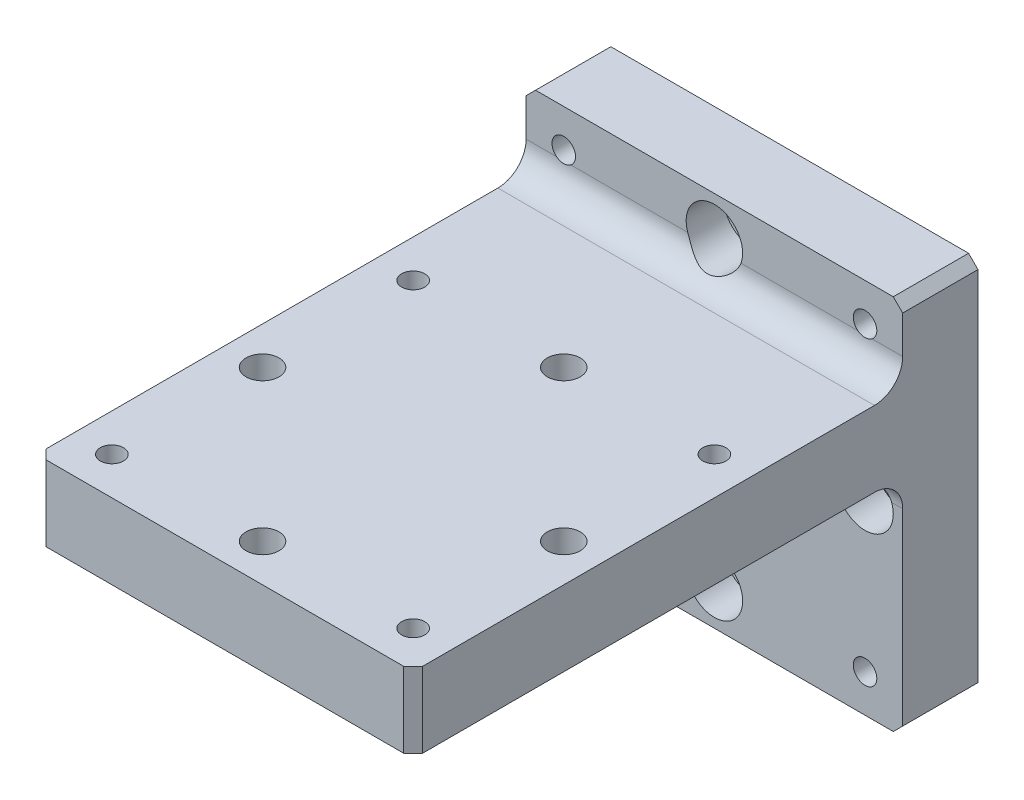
ISO-10303-21;
HEADER;
FILE_DESCRIPTION(('STEP AP214'),'2;1');
FILE_NAME('part.step','',(''),(''),'','','');
FILE_SCHEMA(('AUTOMOTIVE_DESIGN { 1 0 10303 214 1 1 1 1 }'));
ENDSEC;
DATA;
#1=APPLICATION_CONTEXT('core data for automotive mechanical design processes');
#2=APPLICATION_PROTOCOL_DEFINITION('international standard','automotive_design',2000,#1);
#3=PRODUCT_CONTEXT('',#1,'mechanical');
#4=PRODUCT('Part','Part','',(#3));
#5=PRODUCT_RELATED_PRODUCT_CATEGORY('part','',(#4));
#6=PRODUCT_DEFINITION_FORMATION('','',#4);
#7=PRODUCT_DEFINITION_CONTEXT('part definition',#1,'design');
#8=PRODUCT_DEFINITION('design','',#6,#7);
#9=PRODUCT_DEFINITION_SHAPE('','',#8);
#10=(LENGTH_UNIT() NAMED_UNIT(*) SI_UNIT(.MILLI.,.METRE.));
#11=(NAMED_UNIT(*) PLANE_ANGLE_UNIT() SI_UNIT($,.RADIAN.));
#12=(NAMED_UNIT(*) SI_UNIT($,.STERADIAN.) SOLID_ANGLE_UNIT());
#13=UNCERTAINTY_MEASURE_WITH_UNIT(LENGTH_MEASURE(1.E-05),#10,'distance_accuracy_value','');
#14=(GEOMETRIC_REPRESENTATION_CONTEXT(3) GLOBAL_UNCERTAINTY_ASSIGNED_CONTEXT((#13)) GLOBAL_UNIT_ASSIGNED_CONTEXT((#10,
#11,#12)) REPRESENTATION_CONTEXT('',''));
#15=CARTESIAN_POINT('',(0.,0.,0.));
#16=DIRECTION('',(0.,0.,1.));
#17=DIRECTION('',(1.,0.,0.));
#18=AXIS2_PLACEMENT_3D('',#15,#16,#17);
#19=CARTESIAN_POINT('',(0.,-16.,4.));
#20=DIRECTION('',(0.,0.,-1.));
#21=DIRECTION('',(1.,0.,0.));
#22=AXIS2_PLACEMENT_3D('',#19,#20,#21);
#23=PLANE('',#22);
#24=CARTESIAN_POINT('',(0.,-16.,4.));
#25=DIRECTION('',(0.,0.,-1.));
#26=DIRECTION('',(1.,0.,0.));
#27=AXIS2_PLACEMENT_3D('',#24,#25,#26);
#28=CIRCLE('',#27,3.);
#29=CARTESIAN_POINT('',(3.,-16.,4.));
#30=VERTEX_POINT('',#29);
#31=EDGE_CURVE('E447',#30,#30,#28,.F.);
#32=ORIENTED_EDGE('',*,*,#31,.T.);
#33=EDGE_LOOP('',(#32));
#34=FACE_BOUND('',#33,.T.);
#35=CARTESIAN_POINT('',(0.,-16.,4.));
#36=DIRECTION('',(0.,0.,-1.));
#37=DIRECTION('',(1.,0.,0.));
#38=AXIS2_PLACEMENT_3D('',#35,#36,#37);
#39=CIRCLE('',#38,1.75);
#40=CARTESIAN_POINT('',(1.75,-16.,4.));
#41=VERTEX_POINT('',#40);
#42=EDGE_CURVE('E989',#41,#41,#39,.T.);
#43=ORIENTED_EDGE('',*,*,#42,.T.);
#44=EDGE_LOOP('',(#43));
#45=FACE_BOUND('',#44,.T.);
#46=ADVANCED_FACE('F16',(#34,#45),#23,.F.);
#47=CARTESIAN_POINT('',(-16.,0.,4.));
#48=DIRECTION('',(0.,0.,-1.));
#49=DIRECTION('',(1.,0.,0.));
#50=AXIS2_PLACEMENT_3D('',#47,#48,#49);
#51=PLANE('',#50);
#52=CARTESIAN_POINT('',(-16.,0.,4.));
#53=DIRECTION('',(0.,0.,-1.));
#54=DIRECTION('',(1.,0.,0.));
#55=AXIS2_PLACEMENT_3D('',#52,#53,#54);
#56=CIRCLE('',#55,3.);
#57=CARTESIAN_POINT('',(-13.,0.,4.));
#58=VERTEX_POINT('',#57);
#59=EDGE_CURVE('E994',#58,#58,#56,.F.);
#60=ORIENTED_EDGE('',*,*,#59,.T.);
#61=EDGE_LOOP('',(#60));
#62=FACE_BOUND('',#61,.T.);
#63=CARTESIAN_POINT('',(-16.,0.,4.));
#64=DIRECTION('',(0.,0.,-1.));
#65=DIRECTION('',(1.,0.,0.));
#66=AXIS2_PLACEMENT_3D('',#63,#64,#65);
#67=CIRCLE('',#66,1.75);
#68=CARTESIAN_POINT('',(-14.25,0.,4.));
#69=VERTEX_POINT('',#68);
#70=EDGE_CURVE('E985',#69,#69,#67,.T.);
#71=ORIENTED_EDGE('',*,*,#70,.T.);
#72=EDGE_LOOP('',(#71));
#73=FACE_BOUND('',#72,.T.);
#74=ADVANCED_FACE('F769',(#62,#73),#51,.F.);
#75=CARTESIAN_POINT('',(16.,0.,4.));
#76=DIRECTION('',(0.,0.,-1.));
#77=DIRECTION('',(1.,0.,0.));
#78=AXIS2_PLACEMENT_3D('',#75,#76,#77);
#79=PLANE('',#78);
#80=CARTESIAN_POINT('',(16.,0.,4.));
#81=DIRECTION('',(0.,0.,-1.));
#82=DIRECTION('',(1.,0.,0.));
#83=AXIS2_PLACEMENT_3D('',#80,#81,#82);
#84=CIRCLE('',#83,3.);
#85=CARTESIAN_POINT('',(19.,0.,4.));
#86=VERTEX_POINT('',#85);
#87=EDGE_CURVE('E996',#86,#86,#84,.F.);
#88=ORIENTED_EDGE('',*,*,#87,.T.);
#89=EDGE_LOOP('',(#88));
#90=FACE_BOUND('',#89,.T.);
#91=CARTESIAN_POINT('',(16.,0.,4.));
#92=DIRECTION('',(0.,0.,-1.));
#93=DIRECTION('',(1.,0.,0.));
#94=AXIS2_PLACEMENT_3D('',#91,#92,#93);
#95=CIRCLE('',#94,1.75);
#96=CARTESIAN_POINT('',(17.75,0.,4.));
#97=VERTEX_POINT('',#96);
#98=EDGE_CURVE('E984',#97,#97,#95,.T.);
#99=ORIENTED_EDGE('',*,*,#98,.T.);
#100=EDGE_LOOP('',(#99));
#101=FACE_BOUND('',#100,.T.);
#102=ADVANCED_FACE('F759',(#90,#101),#79,.F.);
#103=CARTESIAN_POINT('',(0.,16.,4.));
#104=DIRECTION('',(0.,0.,-1.));
#105=DIRECTION('',(1.,0.,0.));
#106=AXIS2_PLACEMENT_3D('',#103,#104,#105);
#107=PLANE('',#106);
#108=CARTESIAN_POINT('',(0.,16.,4.));
#109=DIRECTION('',(0.,0.,-1.));
#110=DIRECTION('',(1.,0.,0.));
#111=AXIS2_PLACEMENT_3D('',#108,#109,#110);
#112=CIRCLE('',#111,3.);
#113=CARTESIAN_POINT('',(3.,16.,4.));
#114=VERTEX_POINT('',#113);
#115=EDGE_CURVE('E296',#114,#114,#112,.F.);
#116=ORIENTED_EDGE('',*,*,#115,.T.);
#117=EDGE_LOOP('',(#116));
#118=FACE_BOUND('',#117,.T.);
#119=CARTESIAN_POINT('',(0.,16.,4.));
#120=DIRECTION('',(0.,0.,-1.));
#121=DIRECTION('',(1.,0.,0.));
#122=AXIS2_PLACEMENT_3D('',#119,#120,#121);
#123=CIRCLE('',#122,1.75);
#124=CARTESIAN_POINT('',(1.75,16.,4.));
#125=VERTEX_POINT('',#124);
#126=EDGE_CURVE('E982',#125,#125,#123,.T.);
#127=ORIENTED_EDGE('',*,*,#126,.T.);
#128=EDGE_LOOP('',(#127));
#129=FACE_BOUND('',#128,.T.);
#130=ADVANCED_FACE('F750',(#118,#129),#107,.F.);
#131=CARTESIAN_POINT('',(0.,-16.,8.));
#132=DIRECTION('',(0.,0.,-1.));
#133=DIRECTION('',(1.,0.,0.));
#134=AXIS2_PLACEMENT_3D('',#131,#132,#133);
#135=CYLINDRICAL_SURFACE('',#134,3.);
#136=ORIENTED_EDGE('',*,*,#31,.F.);
#137=EDGE_LOOP('',(#136));
#138=FACE_BOUND('',#137,.T.);
#139=CARTESIAN_POINT('',(0.,-16.,8.));
#140=DIRECTION('',(0.,0.,-1.));
#141=DIRECTION('',(1.,0.,0.));
#142=AXIS2_PLACEMENT_3D('',#139,#140,#141);
#143=CIRCLE('',#142,3.);
#144=CARTESIAN_POINT('',(3.,-16.,8.));
#145=VERTEX_POINT('',#144);
#146=EDGE_CURVE('E963',#145,#145,#143,.T.);
#147=ORIENTED_EDGE('',*,*,#146,.F.);
#148=EDGE_LOOP('',(#147));
#149=FACE_BOUND('',#148,.T.);
#150=ADVANCED_FACE('F741',(#138,#149),#135,.F.);
#151=CARTESIAN_POINT('',(16.,0.,8.));
#152=DIRECTION('',(0.,0.,-1.));
#153=DIRECTION('',(1.,0.,0.));
#154=AXIS2_PLACEMENT_3D('',#151,#152,#153);
#155=CYLINDRICAL_SURFACE('',#154,3.);
#156=ORIENTED_EDGE('',*,*,#87,.F.);
#157=EDGE_LOOP('',(#156));
#158=FACE_BOUND('',#157,.T.);
#159=CARTESIAN_POINT('',(18.8284271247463,0.999999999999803,7.99999999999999));
#160=CARTESIAN_POINT('',(18.8031666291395,1.07150090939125,7.99998549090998));
#161=CARTESIAN_POINT('',(18.7751764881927,1.1419923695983,8.00255520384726));
#162=CARTESIAN_POINT('',(18.7141295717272,1.28030386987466,8.01232441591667));
#163=CARTESIAN_POINT('',(18.6810798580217,1.34812747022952,8.0195175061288));
#164=CARTESIAN_POINT('',(18.6105593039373,1.48004425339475,8.03791302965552));
#165=CARTESIAN_POINT('',(18.5731317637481,1.54416593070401,8.0490781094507));
#166=CARTESIAN_POINT('',(18.4939869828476,1.66898013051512,8.0748452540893));
#167=CARTESIAN_POINT('',(18.4522683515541,1.72967153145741,8.08944843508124));
#168=CARTESIAN_POINT('',(18.3216920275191,1.90550730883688,8.13735488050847));
#169=CARTESIAN_POINT('',(18.2269723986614,2.01522981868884,8.17488245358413));
#170=CARTESIAN_POINT('',(18.0240646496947,2.21899792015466,8.25661444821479));
#171=CARTESIAN_POINT('',(17.9158344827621,2.31299232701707,8.30083981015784));
#172=CARTESIAN_POINT('',(17.6708594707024,2.49700448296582,8.39782899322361));
#173=CARTESIAN_POINT('',(17.5322616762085,2.58440689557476,8.45089235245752));
#174=CARTESIAN_POINT('',(17.2412150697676,2.73610312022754,8.55168698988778));
#175=CARTESIAN_POINT('',(17.0887818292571,2.80042251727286,8.59942413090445));
#176=CARTESIAN_POINT('',(16.8051442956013,2.89293173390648,8.67201242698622));
#177=CARTESIAN_POINT('',(16.6762026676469,2.92587194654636,8.69956432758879));
#178=CARTESIAN_POINT('',(16.4130899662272,2.97441972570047,8.74107993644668));
#179=CARTESIAN_POINT('',(16.2789305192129,2.99006377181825,8.75507223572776));
#180=CARTESIAN_POINT('',(16.008368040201,3.00305392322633,8.76664558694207));
#181=CARTESIAN_POINT('',(15.8719577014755,3.00031865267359,8.76415365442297));
#182=CARTESIAN_POINT('',(15.6019071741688,2.97656866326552,8.74314479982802));
#183=CARTESIAN_POINT('',(15.4682714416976,2.95552656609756,8.72460387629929));
#184=CARTESIAN_POINT('',(15.1822637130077,2.89080676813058,8.6704245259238));
#185=CARTESIAN_POINT('',(15.0312144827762,2.84356150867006,8.63218877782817));
#186=CARTESIAN_POINT('',(14.7405955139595,2.72736028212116,8.54613957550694));
#187=CARTESIAN_POINT('',(14.601046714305,2.65836577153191,8.498309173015));
#188=CARTESIAN_POINT('',(14.3320273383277,2.4985689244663,8.39936118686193));
#189=CARTESIAN_POINT('',(14.2028270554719,2.4073424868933,8.3481958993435));
#190=CARTESIAN_POINT('',(13.9594122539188,2.20477123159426,8.25024303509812));
#191=CARTESIAN_POINT('',(13.8451867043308,2.09344136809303,8.20345224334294));
#192=CARTESIAN_POINT('',(13.6485904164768,1.86817801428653,8.12624406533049));
#193=CARTESIAN_POINT('',(13.5640002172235,1.75665457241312,8.09446569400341));
#194=CARTESIAN_POINT('',(13.4103570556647,1.52098418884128,8.04314232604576));
#195=CARTESIAN_POINT('',(13.3412593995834,1.39687509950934,8.02356184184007));
#196=CARTESIAN_POINT('',(13.2607861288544,1.22435587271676,8.00807736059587));
#197=CARTESIAN_POINT('',(13.241449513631,1.18014261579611,8.00507853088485));
#198=CARTESIAN_POINT('',(13.2049017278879,1.09075708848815,8.00104014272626));
#199=CARTESIAN_POINT('',(13.1876906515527,1.04558477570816,8.00000067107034));
#200=CARTESIAN_POINT('',(13.1715728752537,0.999999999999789,8.));
#201=B_SPLINE_CURVE_WITH_KNOTS('',3,(#159,#160,#161,#162,#163,#164,#165,#166,#167,#168,#169,
#170,#171,#172,#173,#174,#175,#176,#177,#178,#179,#180,#181,#182,#183,#184,#185,#186,#187,#188,
#189,#190,#191,#192,#193,#194,#195,#196,#197,#198,#199,#200),.UNSPECIFIED.,.F.,.F.,(4,2,2,2,2,2,
2,2,2,2,2,2,2,2,2,2,2,2,2,2,4),(0.,0.227334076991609,0.454353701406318,0.679292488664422,
0.904304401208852,1.35155196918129,1.80022786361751,2.31485404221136,2.82890803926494,
3.23502946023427,3.64029268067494,4.04735141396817,4.45501996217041,4.94088299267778,
5.42761194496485,5.92447380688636,6.42096758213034,6.84998656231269,7.27775148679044,
7.42272497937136,7.56770489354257),.UNSPECIFIED.);
#202=CARTESIAN_POINT('',(18.8284271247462,0.999999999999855,8.));
#203=VERTEX_POINT('',#202);
#204=CARTESIAN_POINT('',(13.1715728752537,0.999999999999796,8.));
#205=VERTEX_POINT('',#204);
#206=EDGE_CURVE('E359',#203,#205,#201,.T.);
#207=ORIENTED_EDGE('',*,*,#206,.T.);
#208=CARTESIAN_POINT('',(16.,0.,8.));
#209=DIRECTION('',(0.,0.,-1.));
#210=DIRECTION('',(1.,0.,0.));
#211=AXIS2_PLACEMENT_3D('',#208,#209,#210);
#212=CIRCLE('',#211,3.);
#213=EDGE_CURVE('E473',#203,#205,#212,.T.);
#214=ORIENTED_EDGE('',*,*,#213,.F.);
#215=EDGE_LOOP('',(#207,#214));
#216=FACE_BOUND('',#215,.T.);
#217=ADVANCED_FACE('F342',(#158,#216),#155,.F.);
#218=CARTESIAN_POINT('',(-16.,0.,8.));
#219=DIRECTION('',(0.,0.,-1.));
#220=DIRECTION('',(1.,0.,0.));
#221=AXIS2_PLACEMENT_3D('',#218,#219,#220);
#222=CYLINDRICAL_SURFACE('',#221,3.);
#223=ORIENTED_EDGE('',*,*,#59,.F.);
#224=EDGE_LOOP('',(#223));
#225=FACE_BOUND('',#224,.T.);
#226=CARTESIAN_POINT('',(-13.1715728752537,0.999999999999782,8.));
#227=CARTESIAN_POINT('',(-13.1968333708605,1.07150090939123,7.99998549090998));
#228=CARTESIAN_POINT('',(-13.2248235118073,1.14199236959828,8.00255520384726));
#229=CARTESIAN_POINT('',(-13.2858704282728,1.28030386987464,8.01232441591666));
#230=CARTESIAN_POINT('',(-13.3189201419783,1.3481274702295,8.01951750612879));
#231=CARTESIAN_POINT('',(-13.3894406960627,1.48004425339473,8.03791302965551));
#232=CARTESIAN_POINT('',(-13.4268682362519,1.54416593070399,8.0490781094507));
#233=CARTESIAN_POINT('',(-13.5060130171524,1.66898013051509,8.07484525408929));
#234=CARTESIAN_POINT('',(-13.5477316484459,1.72967153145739,8.08944843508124));
#235=CARTESIAN_POINT('',(-13.6783079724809,1.90550730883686,8.13735488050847));
#236=CARTESIAN_POINT('',(-13.7730276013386,2.01522981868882,8.17488245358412));
#237=CARTESIAN_POINT('',(-13.9759353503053,2.21899792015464,8.25661444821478));
#238=CARTESIAN_POINT('',(-14.0841655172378,2.31299232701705,8.30083981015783));
#239=CARTESIAN_POINT('',(-14.3291405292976,2.49700448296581,8.39782899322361));
#240=CARTESIAN_POINT('',(-14.4677383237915,2.58440689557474,8.45089235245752));
#241=CARTESIAN_POINT('',(-14.7587849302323,2.73610312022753,8.55168698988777));
#242=CARTESIAN_POINT('',(-14.9112181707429,2.80042251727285,8.59942413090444));
#243=CARTESIAN_POINT('',(-15.1948557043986,2.89293173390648,8.67201242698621));
#244=CARTESIAN_POINT('',(-15.3237973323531,2.92587194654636,8.69956432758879));
#245=CARTESIAN_POINT('',(-15.5869100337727,2.97441972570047,8.74107993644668));
#246=CARTESIAN_POINT('',(-15.721069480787,2.99006377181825,8.75507223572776));
#247=CARTESIAN_POINT('',(-15.9916319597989,3.00305392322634,8.76664558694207));
#248=CARTESIAN_POINT('',(-16.1280422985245,3.0003186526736,8.76415365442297));
#249=CARTESIAN_POINT('',(-16.3980928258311,2.97656866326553,8.74314479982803));
#250=CARTESIAN_POINT('',(-16.5317285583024,2.95552656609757,8.72460387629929));
#251=CARTESIAN_POINT('',(-16.8177362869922,2.89080676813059,8.67042452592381));
#252=CARTESIAN_POINT('',(-16.9687855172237,2.84356150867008,8.63218877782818));
#253=CARTESIAN_POINT('',(-17.2594044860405,2.72736028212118,8.54613957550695));
#254=CARTESIAN_POINT('',(-17.3989532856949,2.65836577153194,8.49830917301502));
#255=CARTESIAN_POINT('',(-17.6679726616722,2.49856892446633,8.39936118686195));
#256=CARTESIAN_POINT('',(-17.7971729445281,2.40734248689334,8.34819589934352));
#257=CARTESIAN_POINT('',(-18.0405877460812,2.20477123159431,8.25024303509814));
#258=CARTESIAN_POINT('',(-18.1548132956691,2.09344136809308,8.20345224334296));
#259=CARTESIAN_POINT('',(-18.3514095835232,1.86817801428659,8.12624406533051));
#260=CARTESIAN_POINT('',(-18.4359997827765,1.75665457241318,8.09446569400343));
#261=CARTESIAN_POINT('',(-18.5896429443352,1.52098418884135,8.04314232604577));
#262=CARTESIAN_POINT('',(-18.6587406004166,1.39687509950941,8.02356184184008));
#263=CARTESIAN_POINT('',(-18.7392138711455,1.22435587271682,8.00807736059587));
#264=CARTESIAN_POINT('',(-18.758550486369,1.18014261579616,8.00507853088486));
#265=CARTESIAN_POINT('',(-18.795098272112,1.09075708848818,8.00104014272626));
#266=CARTESIAN_POINT('',(-18.8123093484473,1.04558477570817,8.00000067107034));
#267=CARTESIAN_POINT('',(-18.8284271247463,0.999999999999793,8.));
#268=B_SPLINE_CURVE_WITH_KNOTS('',3,(#226,#227,#228,#229,#230,#231,#232,#233,#234,#235,#236,
#237,#238,#239,#240,#241,#242,#243,#244,#245,#246,#247,#248,#249,#250,#251,#252,#253,#254,#255,
#256,#257,#258,#259,#260,#261,#262,#263,#264,#265,#266,#267),.UNSPECIFIED.,.F.,.F.,(4,2,2,2,2,2,
2,2,2,2,2,2,2,2,2,2,2,2,2,2,4),(0.,0.227334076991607,0.454353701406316,0.679292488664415,
0.904304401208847,1.35155196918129,1.8002278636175,2.31485404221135,2.82890803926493,
3.23502946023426,3.64029268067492,4.04735141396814,4.45501996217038,4.94088299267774,
5.4276119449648,5.92447380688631,6.42096758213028,6.84998656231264,7.27775148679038,
7.42272497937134,7.56770489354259),.UNSPECIFIED.);
#269=CARTESIAN_POINT('',(-13.1715728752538,0.999999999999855,8.));
#270=VERTEX_POINT('',#269);
#271=CARTESIAN_POINT('',(-18.8284271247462,0.999999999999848,8.));
#272=VERTEX_POINT('',#271);
#273=EDGE_CURVE('E347',#270,#272,#268,.T.);
#274=ORIENTED_EDGE('',*,*,#273,.T.);
#275=CARTESIAN_POINT('',(-16.,0.,8.));
#276=DIRECTION('',(0.,0.,-1.));
#277=DIRECTION('',(1.,0.,0.));
#278=AXIS2_PLACEMENT_3D('',#275,#276,#277);
#279=CIRCLE('',#278,3.);
#280=EDGE_CURVE('E474',#270,#272,#279,.T.);
#281=ORIENTED_EDGE('',*,*,#280,.F.);
#282=EDGE_LOOP('',(#274,#281));
#283=FACE_BOUND('',#282,.T.);
#284=ADVANCED_FACE('F337',(#225,#283),#222,.F.);
#285=CARTESIAN_POINT('',(0.,-16.,8.));
#286=DIRECTION('',(0.,0.,-1.));
#287=DIRECTION('',(1.,0.,0.));
#288=AXIS2_PLACEMENT_3D('',#285,#286,#287);
#289=CYLINDRICAL_SURFACE('',#288,1.75);
#290=CARTESIAN_POINT('',(0.,-16.,2.72804001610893E-11));
#291=DIRECTION('',(0.,0.,-1.));
#292=DIRECTION('',(1.,0.,0.));
#293=AXIS2_PLACEMENT_3D('',#290,#291,#292);
#294=CIRCLE('',#293,1.75);
#295=CARTESIAN_POINT('',(1.75,-16.,2.72803999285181E-11));
#296=VERTEX_POINT('',#295);
#297=EDGE_CURVE('E229',#296,#296,#294,.F.);
#298=ORIENTED_EDGE('',*,*,#297,.F.);
#299=EDGE_LOOP('',(#298));
#300=FACE_BOUND('',#299,.T.);
#301=ORIENTED_EDGE('',*,*,#42,.F.);
#302=EDGE_LOOP('',(#301));
#303=FACE_BOUND('',#302,.T.);
#304=ADVANCED_FACE('F333',(#300,#303),#289,.F.);
#305=CARTESIAN_POINT('',(-16.,0.,8.));
#306=DIRECTION('',(0.,0.,-1.));
#307=DIRECTION('',(1.,0.,0.));
#308=AXIS2_PLACEMENT_3D('',#305,#306,#307);
#309=CYLINDRICAL_SURFACE('',#308,1.75);
#310=CARTESIAN_POINT('',(-16.,0.,2.72804022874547E-11));
#311=DIRECTION('',(0.,0.,-1.));
#312=DIRECTION('',(1.,0.,0.));
#313=AXIS2_PLACEMENT_3D('',#310,#311,#312);
#314=CIRCLE('',#313,1.75);
#315=CARTESIAN_POINT('',(-14.25,0.,2.72804020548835E-11));
#316=VERTEX_POINT('',#315);
#317=EDGE_CURVE('E573',#316,#316,#314,.F.);
#318=ORIENTED_EDGE('',*,*,#317,.F.);
#319=EDGE_LOOP('',(#318));
#320=FACE_BOUND('',#319,.T.);
#321=ORIENTED_EDGE('',*,*,#70,.F.);
#322=EDGE_LOOP('',(#321));
#323=FACE_BOUND('',#322,.T.);
#324=ADVANCED_FACE('F329',(#320,#323),#309,.F.);
#325=CARTESIAN_POINT('',(0.,16.,8.));
#326=DIRECTION('',(0.,0.,-1.));
#327=DIRECTION('',(1.,0.,0.));
#328=AXIS2_PLACEMENT_3D('',#325,#326,#327);
#329=CYLINDRICAL_SURFACE('',#328,1.75);
#330=CARTESIAN_POINT('',(0.,16.,2.72804001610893E-11));
#331=DIRECTION('',(0.,0.,-1.));
#332=DIRECTION('',(1.,0.,0.));
#333=AXIS2_PLACEMENT_3D('',#330,#331,#332);
#334=CIRCLE('',#333,1.75);
#335=CARTESIAN_POINT('',(1.75,16.,2.72803999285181E-11));
#336=VERTEX_POINT('',#335);
#337=EDGE_CURVE('E576',#336,#336,#334,.F.);
#338=ORIENTED_EDGE('',*,*,#337,.F.);
#339=EDGE_LOOP('',(#338));
#340=FACE_BOUND('',#339,.T.);
#341=ORIENTED_EDGE('',*,*,#126,.F.);
#342=EDGE_LOOP('',(#341));
#343=FACE_BOUND('',#342,.T.);
#344=ADVANCED_FACE('F325',(#340,#343),#329,.F.);
#345=CARTESIAN_POINT('',(16.,0.,8.));
#346=DIRECTION('',(0.,0.,-1.));
#347=DIRECTION('',(1.,0.,0.));
#348=AXIS2_PLACEMENT_3D('',#345,#346,#347);
#349=CYLINDRICAL_SURFACE('',#348,1.75);
#350=CARTESIAN_POINT('',(16.,0.,2.7280398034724E-11));
#351=DIRECTION('',(0.,0.,-1.));
#352=DIRECTION('',(1.,0.,0.));
#353=AXIS2_PLACEMENT_3D('',#350,#351,#352);
#354=CIRCLE('',#353,1.75);
#355=CARTESIAN_POINT('',(17.75,0.,2.72803978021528E-11));
#356=VERTEX_POINT('',#355);
#357=EDGE_CURVE('E579',#356,#356,#354,.F.);
#358=ORIENTED_EDGE('',*,*,#357,.F.);
#359=EDGE_LOOP('',(#358));
#360=FACE_BOUND('',#359,.T.);
#361=ORIENTED_EDGE('',*,*,#98,.F.);
#362=EDGE_LOOP('',(#361));
#363=FACE_BOUND('',#362,.T.);
#364=ADVANCED_FACE('F321',(#360,#363),#349,.F.);
#365=CARTESIAN_POINT('',(-16.,16.,8.01043481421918));
#366=DIRECTION('',(0.,0.,1.));
#367=DIRECTION('',(-1.,0.,0.));
#368=AXIS2_PLACEMENT_3D('',#365,#366,#367);
#369=CYLINDRICAL_SURFACE('',#368,1.25);
#370=CARTESIAN_POINT('',(-16.,16.,0.));
#371=DIRECTION('',(0.,0.,1.));
#372=DIRECTION('',(-1.,0.,0.));
#373=AXIS2_PLACEMENT_3D('',#370,#371,#372);
#374=CIRCLE('',#373,1.25);
#375=CARTESIAN_POINT('',(-17.25,16.,0.));
#376=VERTEX_POINT('',#375);
#377=EDGE_CURVE('E582',#376,#376,#374,.T.);
#378=ORIENTED_EDGE('',*,*,#377,.F.);
#379=EDGE_LOOP('',(#378));
#380=FACE_BOUND('',#379,.T.);
#381=CARTESIAN_POINT('',(-15.2500000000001,14.9999999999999,8.));
#382=CARTESIAN_POINT('',(-15.2781115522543,14.9789165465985,8.00000110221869));
#383=CARTESIAN_POINT('',(-15.3070978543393,14.9590298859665,8.00022203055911));
#384=CARTESIAN_POINT('',(-15.3666351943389,14.9217683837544,8.00096217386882));
#385=CARTESIAN_POINT('',(-15.3971860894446,14.9043933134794,8.0014813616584));
#386=CARTESIAN_POINT('',(-15.4908375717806,14.856247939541,8.00327287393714));
#387=CARTESIAN_POINT('',(-15.5560089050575,14.8294036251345,8.00477986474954));
#388=CARTESIAN_POINT('',(-15.6899260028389,14.7870305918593,8.00749291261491));
#389=CARTESIAN_POINT('',(-15.7586729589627,14.7715056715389,8.00869886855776));
#390=CARTESIAN_POINT('',(-15.8977916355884,14.7522101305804,8.01023489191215));
#391=CARTESIAN_POINT('',(-15.9681627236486,14.7484350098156,8.01056529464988));
#392=CARTESIAN_POINT('',(-16.1084537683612,14.7527392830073,8.01020625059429));
#393=CARTESIAN_POINT('',(-16.1783741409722,14.76080544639,8.0095179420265));
#394=CARTESIAN_POINT('',(-16.3158846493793,14.7885398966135,8.00743012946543));
#395=CARTESIAN_POINT('',(-16.3834744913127,14.8082096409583,8.00603053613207));
#396=CARTESIAN_POINT('',(-16.5026439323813,14.8540667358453,8.0034800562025));
#397=CARTESIAN_POINT('',(-16.5549235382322,14.8784568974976,8.0023295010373));
#398=CARTESIAN_POINT('',(-16.6555947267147,14.9341598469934,8.00059724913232));
#399=CARTESIAN_POINT('',(-16.7039901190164,14.9654657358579,8.00001498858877));
#400=CARTESIAN_POINT('',(-16.7499999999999,14.9999999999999,7.99999999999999));
#401=B_SPLINE_CURVE_WITH_KNOTS('',3,(#381,#382,#383,#384,#385,#386,#387,#388,#389,#390,#391,
#392,#393,#394,#395,#396,#397,#398,#399,#400),.UNSPECIFIED.,.F.,.F.,(4,2,2,2,2,2,2,2,2,4),(0.,
0.105350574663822,0.210691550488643,0.421107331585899,0.631593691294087,0.841999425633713,
1.05217024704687,1.26236747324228,1.43493475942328,1.60733066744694),.UNSPECIFIED.);
#402=CARTESIAN_POINT('',(-15.2500000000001,14.9999999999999,8.));
#403=VERTEX_POINT('',#402);
#404=CARTESIAN_POINT('',(-16.7499999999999,14.9999999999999,8.));
#405=VERTEX_POINT('',#404);
#406=EDGE_CURVE('E297',#403,#405,#401,.T.);
#407=ORIENTED_EDGE('',*,*,#406,.F.);
#408=CARTESIAN_POINT('',(-16.,16.,8.));
#409=DIRECTION('',(0.,0.,1.));
#410=DIRECTION('',(-1.,0.,0.));
#411=AXIS2_PLACEMENT_3D('',#408,#409,#410);
#412=CIRCLE('',#411,1.25);
#413=EDGE_CURVE('E230',#405,#403,#412,.F.);
#414=ORIENTED_EDGE('',*,*,#413,.F.);
#415=EDGE_LOOP('',(#407,#414));
#416=FACE_BOUND('',#415,.T.);
#417=ADVANCED_FACE('F316',(#380,#416),#369,.F.);
#418=CARTESIAN_POINT('',(-16.,-16.,8.01043481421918));
#419=DIRECTION('',(0.,0.,1.));
#420=DIRECTION('',(-1.,0.,0.));
#421=AXIS2_PLACEMENT_3D('',#418,#419,#420);
#422=CYLINDRICAL_SURFACE('',#421,1.25);
#423=CARTESIAN_POINT('',(-16.,-16.,0.));
#424=DIRECTION('',(0.,0.,1.));
#425=DIRECTION('',(-1.,0.,0.));
#426=AXIS2_PLACEMENT_3D('',#423,#424,#425);
#427=CIRCLE('',#426,1.25);
#428=CARTESIAN_POINT('',(-17.25,-16.,0.));
#429=VERTEX_POINT('',#428);
#430=EDGE_CURVE('E585',#429,#429,#427,.T.);
#431=ORIENTED_EDGE('',*,*,#430,.F.);
#432=EDGE_LOOP('',(#431));
#433=FACE_BOUND('',#432,.T.);
#434=CARTESIAN_POINT('',(-16.,-16.,8.));
#435=DIRECTION('',(0.,0.,1.));
#436=DIRECTION('',(-1.,0.,0.));
#437=AXIS2_PLACEMENT_3D('',#434,#435,#436);
#438=CIRCLE('',#437,1.25);
#439=CARTESIAN_POINT('',(-17.25,-16.,8.));
#440=VERTEX_POINT('',#439);
#441=EDGE_CURVE('E968',#440,#440,#438,.F.);
#442=ORIENTED_EDGE('',*,*,#441,.F.);
#443=EDGE_LOOP('',(#442));
#444=FACE_BOUND('',#443,.T.);
#445=ADVANCED_FACE('F313',(#433,#444),#422,.F.);
#446=CARTESIAN_POINT('',(16.,-16.,8.01043481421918));
#447=DIRECTION('',(0.,0.,1.));
#448=DIRECTION('',(-1.,0.,0.));
#449=AXIS2_PLACEMENT_3D('',#446,#447,#448);
#450=CYLINDRICAL_SURFACE('',#449,1.25);
#451=CARTESIAN_POINT('',(16.,-16.,0.));
#452=DIRECTION('',(0.,0.,1.));
#453=DIRECTION('',(-1.,0.,0.));
#454=AXIS2_PLACEMENT_3D('',#451,#452,#453);
#455=CIRCLE('',#454,1.25);
#456=CARTESIAN_POINT('',(14.75,-16.,0.));
#457=VERTEX_POINT('',#456);
#458=EDGE_CURVE('E588',#457,#457,#455,.T.);
#459=ORIENTED_EDGE('',*,*,#458,.F.);
#460=EDGE_LOOP('',(#459));
#461=FACE_BOUND('',#460,.T.);
#462=CARTESIAN_POINT('',(16.,-16.,8.));
#463=DIRECTION('',(0.,0.,1.));
#464=DIRECTION('',(-1.,0.,0.));
#465=AXIS2_PLACEMENT_3D('',#462,#463,#464);
#466=CIRCLE('',#465,1.25);
#467=CARTESIAN_POINT('',(14.75,-16.,8.));
#468=VERTEX_POINT('',#467);
#469=EDGE_CURVE('E959',#468,#468,#466,.F.);
#470=ORIENTED_EDGE('',*,*,#469,.F.);
#471=EDGE_LOOP('',(#470));
#472=FACE_BOUND('',#471,.T.);
#473=ADVANCED_FACE('F309',(#461,#472),#450,.F.);
#474=CARTESIAN_POINT('',(16.,16.,8.01043481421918));
#475=DIRECTION('',(0.,0.,1.));
#476=DIRECTION('',(-1.,0.,0.));
#477=AXIS2_PLACEMENT_3D('',#474,#475,#476);
#478=CYLINDRICAL_SURFACE('',#477,1.25);
#479=CARTESIAN_POINT('',(16.,16.,0.));
#480=DIRECTION('',(0.,0.,1.));
#481=DIRECTION('',(-1.,0.,0.));
#482=AXIS2_PLACEMENT_3D('',#479,#480,#481);
#483=CIRCLE('',#482,1.25);
#484=CARTESIAN_POINT('',(14.75,16.,0.));
#485=VERTEX_POINT('',#484);
#486=EDGE_CURVE('E243',#485,#485,#483,.T.);
#487=ORIENTED_EDGE('',*,*,#486,.F.);
#488=EDGE_LOOP('',(#487));
#489=FACE_BOUND('',#488,.T.);
#490=CARTESIAN_POINT('',(16.7499999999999,14.9999999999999,7.99999999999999));
#491=CARTESIAN_POINT('',(16.7218884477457,14.9789165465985,8.00000110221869));
#492=CARTESIAN_POINT('',(16.6929021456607,14.9590298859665,8.00022203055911));
#493=CARTESIAN_POINT('',(16.6333648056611,14.9217683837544,8.00096217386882));
#494=CARTESIAN_POINT('',(16.6028139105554,14.9043933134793,8.0014813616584));
#495=CARTESIAN_POINT('',(16.5091624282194,14.8562479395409,8.00327287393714));
#496=CARTESIAN_POINT('',(16.4439910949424,14.8294036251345,8.00477986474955));
#497=CARTESIAN_POINT('',(16.3100739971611,14.7870305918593,8.00749291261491));
#498=CARTESIAN_POINT('',(16.2413270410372,14.7715056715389,8.00869886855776));
#499=CARTESIAN_POINT('',(16.1022083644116,14.7522101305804,8.01023489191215));
#500=CARTESIAN_POINT('',(16.0318372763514,14.7484350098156,8.01056529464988));
#501=CARTESIAN_POINT('',(15.8915462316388,14.7527392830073,8.01020625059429));
#502=CARTESIAN_POINT('',(15.8216258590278,14.76080544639,8.0095179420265));
#503=CARTESIAN_POINT('',(15.6841153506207,14.7885398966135,8.00743012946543));
#504=CARTESIAN_POINT('',(15.6165255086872,14.8082096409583,8.00603053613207));
#505=CARTESIAN_POINT('',(15.4973560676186,14.8540667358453,8.0034800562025));
#506=CARTESIAN_POINT('',(15.4450764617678,14.8784568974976,8.0023295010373));
#507=CARTESIAN_POINT('',(15.3444052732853,14.9341598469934,8.00059724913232));
#508=CARTESIAN_POINT('',(15.2960098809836,14.9654657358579,8.00001498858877));
#509=CARTESIAN_POINT('',(15.2500000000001,14.9999999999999,7.99999999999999));
#510=B_SPLINE_CURVE_WITH_KNOTS('',3,(#490,#491,#492,#493,#494,#495,#496,#497,#498,#499,#500,
#501,#502,#503,#504,#505,#506,#507,#508,#509),.UNSPECIFIED.,.F.,.F.,(4,2,2,2,2,2,2,2,2,4),(0.,
0.10535057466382,0.210691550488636,0.421107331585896,0.631593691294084,0.841999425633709,
1.05217024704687,1.26236747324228,1.43493475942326,1.6073306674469),.UNSPECIFIED.);
#511=CARTESIAN_POINT('',(16.7499999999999,14.9999999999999,8.));
#512=VERTEX_POINT('',#511);
#513=CARTESIAN_POINT('',(15.2500000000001,14.9999999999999,8.));
#514=VERTEX_POINT('',#513);
#515=EDGE_CURVE('E290',#512,#514,#510,.T.);
#516=ORIENTED_EDGE('',*,*,#515,.F.);
#517=CARTESIAN_POINT('',(16.,16.,8.));
#518=DIRECTION('',(0.,0.,1.));
#519=DIRECTION('',(-1.,0.,0.));
#520=AXIS2_PLACEMENT_3D('',#517,#518,#519);
#521=CIRCLE('',#520,1.25);
#522=EDGE_CURVE('E562',#514,#512,#521,.F.);
#523=ORIENTED_EDGE('',*,*,#522,.F.);
#524=EDGE_LOOP('',(#516,#523));
#525=FACE_BOUND('',#524,.T.);
#526=ADVANCED_FACE('F305',(#489,#525),#478,.F.);
#527=CARTESIAN_POINT('',(0.,16.,8.));
#528=DIRECTION('',(0.,0.,-1.));
#529=DIRECTION('',(1.,0.,0.));
#530=AXIS2_PLACEMENT_3D('',#527,#528,#529);
#531=CYLINDRICAL_SURFACE('',#530,3.);
#532=ORIENTED_EDGE('',*,*,#115,.F.);
#533=EDGE_LOOP('',(#532));
#534=FACE_BOUND('',#533,.T.);
#535=CARTESIAN_POINT('',(-2.82842712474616,14.9999999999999,8.));
#536=CARTESIAN_POINT('',(-2.80316662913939,14.9284990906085,7.99998549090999));
#537=CARTESIAN_POINT('',(-2.77517648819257,14.8580076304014,8.00255520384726));
#538=CARTESIAN_POINT('',(-2.71412957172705,14.7196961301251,8.01232441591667));
#539=CARTESIAN_POINT('',(-2.68107985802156,14.6518725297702,8.01951750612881));
#540=CARTESIAN_POINT('',(-2.61055930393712,14.519955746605,8.03791302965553));
#541=CARTESIAN_POINT('',(-2.57313176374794,14.4558340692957,8.04907810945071));
#542=CARTESIAN_POINT('',(-2.49398698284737,14.3310198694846,8.07484525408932));
#543=CARTESIAN_POINT('',(-2.45226835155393,14.2703284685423,8.08944843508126));
#544=CARTESIAN_POINT('',(-2.3216920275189,14.0944926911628,8.1373548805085));
#545=CARTESIAN_POINT('',(-2.22697239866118,13.9847701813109,8.17488245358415));
#546=CARTESIAN_POINT('',(-2.02406464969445,13.7810020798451,8.25661444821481));
#547=CARTESIAN_POINT('',(-1.91583448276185,13.6870076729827,8.30083981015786));
#548=CARTESIAN_POINT('',(-1.67085947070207,13.502995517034,8.39782899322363));
#549=CARTESIAN_POINT('',(-1.53226167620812,13.415593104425,8.45089235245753));
#550=CARTESIAN_POINT('',(-1.24121506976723,13.2638968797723,8.55168698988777));
#551=CARTESIAN_POINT('',(-1.08878182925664,13.199577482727,8.59942413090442));
#552=CARTESIAN_POINT('',(-0.805144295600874,13.1070682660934,8.67201242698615));
#553=CARTESIAN_POINT('',(-0.676202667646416,13.0741280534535,8.69956432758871));
#554=CARTESIAN_POINT('',(-0.413089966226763,13.0255802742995,8.74107993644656));
#555=CARTESIAN_POINT('',(-0.278930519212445,13.0099362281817,8.75507223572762));
#556=CARTESIAN_POINT('',(-0.00836804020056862,12.9969460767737,8.76664558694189));
#557=CARTESIAN_POINT('',(0.128042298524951,12.9996813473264,8.76415365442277));
#558=CARTESIAN_POINT('',(0.398092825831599,13.0234313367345,8.74314479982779));
#559=CARTESIAN_POINT('',(0.531728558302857,13.0444734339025,8.72460387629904));
#560=CARTESIAN_POINT('',(0.817736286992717,13.1091932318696,8.67042452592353));
#561=CARTESIAN_POINT('',(0.968785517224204,13.1564384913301,8.63218877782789));
#562=CARTESIAN_POINT('',(1.25940448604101,13.2726397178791,8.54613957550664));
#563=CARTESIAN_POINT('',(1.39895328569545,13.3416342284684,8.4983091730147));
#564=CARTESIAN_POINT('',(1.66797266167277,13.501431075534,8.39936118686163));
#565=CARTESIAN_POINT('',(1.79717294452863,13.5926575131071,8.34819589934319));
#566=CARTESIAN_POINT('',(2.04058774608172,13.7952287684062,8.25024303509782));
#567=CARTESIAN_POINT('',(2.15481329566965,13.9065586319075,8.20345224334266));
#568=CARTESIAN_POINT('',(2.35140958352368,14.1318219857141,8.12624406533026));
#569=CARTESIAN_POINT('',(2.43599978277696,14.2433454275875,8.0944656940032));
#570=CARTESIAN_POINT('',(2.58964294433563,14.4790158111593,8.04314232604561));
#571=CARTESIAN_POINT('',(2.65874060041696,14.6031249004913,8.02356184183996));
#572=CARTESIAN_POINT('',(2.73921387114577,14.7756441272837,8.00807736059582));
#573=CARTESIAN_POINT('',(2.75855048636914,14.8198573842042,8.00507853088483));
#574=CARTESIAN_POINT('',(2.79509827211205,14.9092429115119,8.00104014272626));
#575=CARTESIAN_POINT('',(2.81230934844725,14.9544152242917,8.00000067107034));
#576=CARTESIAN_POINT('',(2.82842712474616,14.9999999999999,7.99999999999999));
#577=B_SPLINE_CURVE_WITH_KNOTS('',3,(#535,#536,#537,#538,#539,#540,#541,#542,#543,#544,#545,
#546,#547,#548,#549,#550,#551,#552,#553,#554,#555,#556,#557,#558,#559,#560,#561,#562,#563,#564,
#565,#566,#567,#568,#569,#570,#571,#572,#573,#574,#575,#576),.UNSPECIFIED.,.F.,.F.,(4,2,2,2,2,2,
2,2,2,2,2,2,2,2,2,2,2,2,2,2,4),(0.,0.227334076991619,0.45435370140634,0.679292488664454,
0.904304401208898,1.35155196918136,1.8002278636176,2.31485404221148,2.82890803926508,
3.2350294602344,3.64029268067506,4.04735141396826,4.45501996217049,4.94088299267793,
5.42761194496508,5.92447380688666,6.42096758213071,6.84998656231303,7.27775148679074,
7.42272497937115,7.56770489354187),.UNSPECIFIED.);
#578=CARTESIAN_POINT('',(-2.82842712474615,14.9999999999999,8.));
#579=VERTEX_POINT('',#578);
#580=CARTESIAN_POINT('',(2.82842712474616,14.9999999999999,8.));
#581=VERTEX_POINT('',#580);
#582=EDGE_CURVE('E264',#579,#581,#577,.T.);
#583=ORIENTED_EDGE('',*,*,#582,.T.);
#584=CARTESIAN_POINT('',(0.,16.,8.));
#585=DIRECTION('',(0.,0.,-1.));
#586=DIRECTION('',(1.,0.,0.));
#587=AXIS2_PLACEMENT_3D('',#584,#585,#586);
#588=CIRCLE('',#587,3.);
#589=EDGE_CURVE('E356',#579,#581,#588,.T.);
#590=ORIENTED_EDGE('',*,*,#589,.F.);
#591=EDGE_LOOP('',(#583,#590));
#592=FACE_BOUND('',#591,.T.);
#593=ADVANCED_FACE('F275',(#534,#592),#531,.F.);
#594=CARTESIAN_POINT('',(0.,-20.,0.));
#595=DIRECTION('',(0.,-1.,0.));
#596=DIRECTION('',(1.,0.,0.));
#597=AXIS2_PLACEMENT_3D('',#594,#595,#596);
#598=PLANE('',#597);
#599=DIRECTION('',(-1.,0.,0.));
#600=VECTOR('',#599,1.);
#601=CARTESIAN_POINT('',(212.814485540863,-20.,8.));
#602=LINE('',#601,#600);
#603=CARTESIAN_POINT('',(-19.,-20.,8.));
#604=VERTEX_POINT('',#603);
#605=CARTESIAN_POINT('',(19.0000000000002,-19.9999999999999,8.));
#606=VERTEX_POINT('',#605);
#607=EDGE_CURVE('E469',#604,#606,#602,.F.);
#608=ORIENTED_EDGE('',*,*,#607,.F.);
#609=DIRECTION('',(0.,0.,-1.));
#610=VECTOR('',#609,1.);
#611=CARTESIAN_POINT('',(-19.,-20.,0.));
#612=LINE('',#611,#610);
#613=CARTESIAN_POINT('',(-19.,-20.,0.));
#614=VERTEX_POINT('',#613);
#615=EDGE_CURVE('E206',#604,#614,#612,.T.);
#616=ORIENTED_EDGE('',*,*,#615,.T.);
#617=DIRECTION('',(1.,0.,0.));
#618=VECTOR('',#617,1.);
#619=CARTESIAN_POINT('',(0.,-20.,0.));
#620=LINE('',#619,#618);
#621=CARTESIAN_POINT('',(19.,-20.,0.));
#622=VERTEX_POINT('',#621);
#623=EDGE_CURVE('E242',#622,#614,#620,.F.);
#624=ORIENTED_EDGE('',*,*,#623,.F.);
#625=DIRECTION('',(0.,0.,1.));
#626=VECTOR('',#625,1.);
#627=CARTESIAN_POINT('',(19.,-20.,0.));
#628=LINE('',#627,#626);
#629=EDGE_CURVE('E517',#622,#606,#628,.T.);
#630=ORIENTED_EDGE('',*,*,#629,.T.);
#631=EDGE_LOOP('',(#608,#616,#624,#630));
#632=FACE_BOUND('',#631,.T.);
#633=ADVANCED_FACE('F376',(#632),#598,.T.);
#634=CARTESIAN_POINT('',(212.814485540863,-575.628971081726,8.));
#635=DIRECTION('',(0.,0.,1.));
#636=DIRECTION('',(-1.,0.,0.));
#637=AXIS2_PLACEMENT_3D('',#634,#635,#636);
#638=PLANE('',#637);
#639=ORIENTED_EDGE('',*,*,#469,.T.);
#640=EDGE_LOOP('',(#639));
#641=FACE_BOUND('',#640,.T.);
#642=ORIENTED_EDGE('',*,*,#441,.T.);
#643=EDGE_LOOP('',(#642));
#644=FACE_BOUND('',#643,.T.);
#645=DIRECTION('',(0.,-1.,0.));
#646=VECTOR('',#645,1.);
#647=CARTESIAN_POINT('',(-20.,0.,8.));
#648=LINE('',#647,#646);
#649=CARTESIAN_POINT('',(-20.,-19.,8.));
#650=VERTEX_POINT('',#649);
#651=CARTESIAN_POINT('',(-20.,0.999999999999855,8.));
#652=VERTEX_POINT('',#651);
#653=EDGE_CURVE('E263',#650,#652,#648,.F.);
#654=ORIENTED_EDGE('',*,*,#653,.F.);
#655=DIRECTION('',(-0.70710678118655,0.707106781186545,0.));
#656=VECTOR('',#655,1.);
#657=CARTESIAN_POINT('',(374.721728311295,-413.721728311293,8.));
#658=LINE('',#657,#656);
#659=EDGE_CURVE('E515',#650,#604,#658,.F.);
#660=ORIENTED_EDGE('',*,*,#659,.T.);
#661=ORIENTED_EDGE('',*,*,#607,.T.);
#662=DIRECTION('',(-0.70710678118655,-0.707106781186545,0.));
#663=VECTOR('',#662,1.);
#664=CARTESIAN_POINT('',(-161.907242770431,-200.90724277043,8.));
#665=LINE('',#664,#663);
#666=CARTESIAN_POINT('',(20.,-19.0000000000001,8.));
#667=VERTEX_POINT('',#666);
#668=EDGE_CURVE('E468',#606,#667,#665,.F.);
#669=ORIENTED_EDGE('',*,*,#668,.T.);
#670=DIRECTION('',(0.,1.,0.));
#671=VECTOR('',#670,1.);
#672=CARTESIAN_POINT('',(20.,0.,8.));
#673=LINE('',#672,#671);
#674=CARTESIAN_POINT('',(20.,0.999999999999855,8.));
#675=VERTEX_POINT('',#674);
#676=EDGE_CURVE('E523',#675,#667,#673,.F.);
#677=ORIENTED_EDGE('',*,*,#676,.F.);
#678=DIRECTION('',(1.,0.,0.));
#679=VECTOR('',#678,1.);
#680=CARTESIAN_POINT('',(212.814485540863,0.999999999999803,8.));
#681=LINE('',#680,#679);
#682=EDGE_CURVE('E956',#675,#203,#681,.F.);
#683=ORIENTED_EDGE('',*,*,#682,.T.);
#684=ORIENTED_EDGE('',*,*,#213,.T.);
#685=DIRECTION('',(1.,0.,0.));
#686=VECTOR('',#685,1.);
#687=CARTESIAN_POINT('',(212.814485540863,0.999999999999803,8.));
#688=LINE('',#687,#686);
#689=EDGE_CURVE('E357',#205,#270,#688,.F.);
#690=ORIENTED_EDGE('',*,*,#689,.T.);
#691=ORIENTED_EDGE('',*,*,#280,.T.);
#692=DIRECTION('',(1.,0.,0.));
#693=VECTOR('',#692,1.);
#694=CARTESIAN_POINT('',(212.814485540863,0.999999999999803,8.));
#695=LINE('',#694,#693);
#696=EDGE_CURVE('E479',#272,#652,#695,.F.);
#697=ORIENTED_EDGE('',*,*,#696,.T.);
#698=EDGE_LOOP('',(#654,#660,#661,#669,#677,#683,#684,#690,#691,#697));
#699=FACE_BOUND('',#698,.T.);
#700=ORIENTED_EDGE('',*,*,#146,.T.);
#701=EDGE_LOOP('',(#700));
#702=FACE_BOUND('',#701,.T.);
#703=ADVANCED_FACE('F371',(#641,#644,#699,#702),#638,.T.);
#704=CARTESIAN_POINT('',(212.814485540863,0.9999999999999,11.));
#705=DIRECTION('',(1.,0.,0.));
#706=DIRECTION('',(0.,1.,0.));
#707=AXIS2_PLACEMENT_3D('',#704,#705,#706);
#708=CYLINDRICAL_SURFACE('',#707,3.);
#709=ORIENTED_EDGE('',*,*,#689,.F.);
#710=ORIENTED_EDGE('',*,*,#206,.F.);
#711=ORIENTED_EDGE('',*,*,#682,.F.);
#712=CARTESIAN_POINT('',(20.,0.9999999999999,11.));
#713=DIRECTION('',(1.,0.,0.));
#714=DIRECTION('',(0.,1.,0.));
#715=AXIS2_PLACEMENT_3D('',#712,#713,#714);
#716=CIRCLE('',#715,3.);
#717=CARTESIAN_POINT('',(20.,3.9999999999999,11.));
#718=VERTEX_POINT('',#717);
#719=EDGE_CURVE('E534',#718,#675,#716,.F.);
#720=ORIENTED_EDGE('',*,*,#719,.F.);
#721=DIRECTION('',(-1.,0.,0.));
#722=VECTOR('',#721,1.);
#723=CARTESIAN_POINT('',(212.814485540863,3.9999999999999,11.));
#724=LINE('',#723,#722);
#725=CARTESIAN_POINT('',(-20.,3.9999999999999,11.));
#726=VERTEX_POINT('',#725);
#727=EDGE_CURVE('E222',#726,#718,#724,.F.);
#728=ORIENTED_EDGE('',*,*,#727,.F.);
#729=CARTESIAN_POINT('',(-20.,0.9999999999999,11.));
#730=DIRECTION('',(1.,0.,0.));
#731=DIRECTION('',(0.,1.,0.));
#732=AXIS2_PLACEMENT_3D('',#729,#730,#731);
#733=CIRCLE('',#732,3.);
#734=EDGE_CURVE('E260',#652,#726,#733,.T.);
#735=ORIENTED_EDGE('',*,*,#734,.F.);
#736=ORIENTED_EDGE('',*,*,#696,.F.);
#737=ORIENTED_EDGE('',*,*,#273,.F.);
#738=EDGE_LOOP('',(#709,#710,#711,#720,#728,#735,#736,#737));
#739=FACE_BOUND('',#738,.T.);
#740=ADVANCED_FACE('F365',(#739),#708,.F.);
#741=CARTESIAN_POINT('',(212.814485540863,14.9999999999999,8.));
#742=DIRECTION('',(0.,0.,1.));
#743=DIRECTION('',(-1.,0.,0.));
#744=AXIS2_PLACEMENT_3D('',#741,#742,#743);
#745=PLANE('',#744);
#746=DIRECTION('',(0.,1.,0.));
#747=VECTOR('',#746,1.);
#748=CARTESIAN_POINT('',(20.,0.,8.));
#749=LINE('',#748,#747);
#750=CARTESIAN_POINT('',(20.,19.,8.));
#751=VERTEX_POINT('',#750);
#752=CARTESIAN_POINT('',(20.,14.9999999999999,8.));
#753=VERTEX_POINT('',#752);
#754=EDGE_CURVE('E541',#751,#753,#749,.F.);
#755=ORIENTED_EDGE('',*,*,#754,.F.);
#756=DIRECTION('',(0.70710678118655,-0.707106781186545,0.));
#757=VECTOR('',#756,1.);
#758=CARTESIAN_POINT('',(118.407242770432,-79.4072427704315,8.));
#759=LINE('',#758,#757);
#760=CARTESIAN_POINT('',(19.,20.,8.));
#761=VERTEX_POINT('',#760);
#762=EDGE_CURVE('E235',#751,#761,#759,.F.);
#763=ORIENTED_EDGE('',*,*,#762,.T.);
#764=DIRECTION('',(-1.,0.,0.));
#765=VECTOR('',#764,1.);
#766=CARTESIAN_POINT('',(0.,20.,8.));
#767=LINE('',#766,#765);
#768=CARTESIAN_POINT('',(-19.,20.,8.));
#769=VERTEX_POINT('',#768);
#770=EDGE_CURVE('E225',#769,#761,#767,.F.);
#771=ORIENTED_EDGE('',*,*,#770,.F.);
#772=DIRECTION('',(0.70710678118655,0.707106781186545,0.));
#773=VECTOR('',#772,1.);
#774=CARTESIAN_POINT('',(94.4072427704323,133.407242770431,8.));
#775=LINE('',#774,#773);
#776=CARTESIAN_POINT('',(-20.,19.,8.));
#777=VERTEX_POINT('',#776);
#778=EDGE_CURVE('E233',#769,#777,#775,.F.);
#779=ORIENTED_EDGE('',*,*,#778,.T.);
#780=DIRECTION('',(0.,-1.,0.));
#781=VECTOR('',#780,1.);
#782=CARTESIAN_POINT('',(-20.,0.,8.));
#783=LINE('',#782,#781);
#784=CARTESIAN_POINT('',(-20.,14.9999999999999,8.));
#785=VERTEX_POINT('',#784);
#786=EDGE_CURVE('E171',#785,#777,#783,.F.);
#787=ORIENTED_EDGE('',*,*,#786,.F.);
#788=DIRECTION('',(1.,0.,0.));
#789=VECTOR('',#788,1.);
#790=CARTESIAN_POINT('',(212.814485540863,14.9999999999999,8.));
#791=LINE('',#790,#789);
#792=EDGE_CURVE('E167',#785,#405,#791,.T.);
#793=ORIENTED_EDGE('',*,*,#792,.T.);
#794=ORIENTED_EDGE('',*,*,#413,.T.);
#795=DIRECTION('',(1.,0.,0.));
#796=VECTOR('',#795,1.);
#797=CARTESIAN_POINT('',(212.814485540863,14.9999999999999,8.));
#798=LINE('',#797,#796);
#799=EDGE_CURVE('E200',#403,#579,#798,.T.);
#800=ORIENTED_EDGE('',*,*,#799,.T.);
#801=ORIENTED_EDGE('',*,*,#589,.T.);
#802=DIRECTION('',(1.,0.,0.));
#803=VECTOR('',#802,1.);
#804=CARTESIAN_POINT('',(212.814485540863,14.9999999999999,8.));
#805=LINE('',#804,#803);
#806=EDGE_CURVE('E547',#581,#514,#805,.T.);
#807=ORIENTED_EDGE('',*,*,#806,.T.);
#808=ORIENTED_EDGE('',*,*,#522,.T.);
#809=DIRECTION('',(1.,0.,0.));
#810=VECTOR('',#809,1.);
#811=CARTESIAN_POINT('',(212.814485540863,14.9999999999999,8.));
#812=LINE('',#811,#810);
#813=EDGE_CURVE('E559',#512,#753,#812,.T.);
#814=ORIENTED_EDGE('',*,*,#813,.T.);
#815=EDGE_LOOP('',(#755,#763,#771,#779,#787,#793,#794,#800,#801,#807,#808,#814));
#816=FACE_BOUND('',#815,.T.);
#817=ADVANCED_FACE('F370',(#816),#745,.T.);
#818=CARTESIAN_POINT('',(0.,20.,0.));
#819=DIRECTION('',(0.,1.,0.));
#820=DIRECTION('',(-1.,0.,0.));
#821=AXIS2_PLACEMENT_3D('',#818,#819,#820);
#822=PLANE('',#821);
#823=ORIENTED_EDGE('',*,*,#770,.T.);
#824=DIRECTION('',(0.,0.,-1.));
#825=VECTOR('',#824,1.);
#826=CARTESIAN_POINT('',(19.,20.,0.));
#827=LINE('',#826,#825);
#828=CARTESIAN_POINT('',(19.,20.,0.));
#829=VERTEX_POINT('',#828);
#830=EDGE_CURVE('E486',#761,#829,#827,.T.);
#831=ORIENTED_EDGE('',*,*,#830,.T.);
#832=DIRECTION('',(1.,0.,0.));
#833=VECTOR('',#832,1.);
#834=CARTESIAN_POINT('',(0.,20.,0.));
#835=LINE('',#834,#833);
#836=CARTESIAN_POINT('',(-19.,20.,0.));
#837=VERTEX_POINT('',#836);
#838=EDGE_CURVE('E238',#837,#829,#835,.T.);
#839=ORIENTED_EDGE('',*,*,#838,.F.);
#840=DIRECTION('',(0.,0.,1.));
#841=VECTOR('',#840,1.);
#842=CARTESIAN_POINT('',(-19.,20.,0.));
#843=LINE('',#842,#841);
#844=EDGE_CURVE('E237',#837,#769,#843,.T.);
#845=ORIENTED_EDGE('',*,*,#844,.T.);
#846=EDGE_LOOP('',(#823,#831,#839,#845));
#847=FACE_BOUND('',#846,.T.);
#848=ADVANCED_FACE('F503',(#847),#822,.T.);
#849=CARTESIAN_POINT('',(0.,0.,0.));
#850=DIRECTION('',(0.,0.,-1.));
#851=DIRECTION('',(1.,0.,0.));
#852=AXIS2_PLACEMENT_3D('',#849,#850,#851);
#853=PLANE('',#852);
#854=ORIENTED_EDGE('',*,*,#838,.T.);
#855=DIRECTION('',(-0.70710678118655,0.707106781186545,0.));
#856=VECTOR('',#855,1.);
#857=CARTESIAN_POINT('',(19.4999999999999,19.5000000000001,0.));
#858=LINE('',#857,#856);
#859=CARTESIAN_POINT('',(20.,19.,0.));
#860=VERTEX_POINT('',#859);
#861=EDGE_CURVE('E457',#829,#860,#858,.F.);
#862=ORIENTED_EDGE('',*,*,#861,.T.);
#863=DIRECTION('',(0.,1.,0.));
#864=VECTOR('',#863,1.);
#865=CARTESIAN_POINT('',(20.,0.,0.));
#866=LINE('',#865,#864);
#867=CARTESIAN_POINT('',(20.,-19.,0.));
#868=VERTEX_POINT('',#867);
#869=EDGE_CURVE('E535',#868,#860,#866,.T.);
#870=ORIENTED_EDGE('',*,*,#869,.F.);
#871=DIRECTION('',(0.70710678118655,0.707106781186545,0.));
#872=VECTOR('',#871,1.);
#873=CARTESIAN_POINT('',(19.4999999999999,-19.5000000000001,0.));
#874=LINE('',#873,#872);
#875=EDGE_CURVE('E489',#868,#622,#874,.F.);
#876=ORIENTED_EDGE('',*,*,#875,.T.);
#877=ORIENTED_EDGE('',*,*,#623,.T.);
#878=DIRECTION('',(0.70710678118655,-0.707106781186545,0.));
#879=VECTOR('',#878,1.);
#880=CARTESIAN_POINT('',(-19.4999999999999,-19.5000000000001,0.));
#881=LINE('',#880,#879);
#882=CARTESIAN_POINT('',(-20.,-19.,0.));
#883=VERTEX_POINT('',#882);
#884=EDGE_CURVE('E491',#614,#883,#881,.F.);
#885=ORIENTED_EDGE('',*,*,#884,.T.);
#886=DIRECTION('',(0.,-1.,0.));
#887=VECTOR('',#886,1.);
#888=CARTESIAN_POINT('',(-20.,0.,0.));
#889=LINE('',#888,#887);
#890=CARTESIAN_POINT('',(-20.,19.,0.));
#891=VERTEX_POINT('',#890);
#892=EDGE_CURVE('E212',#891,#883,#889,.T.);
#893=ORIENTED_EDGE('',*,*,#892,.F.);
#894=DIRECTION('',(-0.70710678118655,-0.707106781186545,0.));
#895=VECTOR('',#894,1.);
#896=CARTESIAN_POINT('',(-19.4999999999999,19.5000000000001,0.));
#897=LINE('',#896,#895);
#898=EDGE_CURVE('E462',#891,#837,#897,.F.);
#899=ORIENTED_EDGE('',*,*,#898,.T.);
#900=EDGE_LOOP('',(#854,#862,#870,#876,#877,#885,#893,#899));
#901=FACE_BOUND('',#900,.T.);
#902=ORIENTED_EDGE('',*,*,#486,.T.);
#903=EDGE_LOOP('',(#902));
#904=FACE_BOUND('',#903,.T.);
#905=ORIENTED_EDGE('',*,*,#458,.T.);
#906=EDGE_LOOP('',(#905));
#907=FACE_BOUND('',#906,.T.);
#908=ORIENTED_EDGE('',*,*,#430,.T.);
#909=EDGE_LOOP('',(#908));
#910=FACE_BOUND('',#909,.T.);
#911=ORIENTED_EDGE('',*,*,#377,.T.);
#912=EDGE_LOOP('',(#911));
#913=FACE_BOUND('',#912,.T.);
#914=ORIENTED_EDGE('',*,*,#357,.T.);
#915=EDGE_LOOP('',(#914));
#916=FACE_BOUND('',#915,.T.);
#917=ORIENTED_EDGE('',*,*,#337,.T.);
#918=EDGE_LOOP('',(#917));
#919=FACE_BOUND('',#918,.T.);
#920=ORIENTED_EDGE('',*,*,#317,.T.);
#921=EDGE_LOOP('',(#920));
#922=FACE_BOUND('',#921,.T.);
#923=ORIENTED_EDGE('',*,*,#297,.T.);
#924=EDGE_LOOP('',(#923));
#925=FACE_BOUND('',#924,.T.);
#926=ADVANCED_FACE('F496',(#901,#904,#907,#910,#913,#916,#919,#922,#925),#853,.T.);
#927=CARTESIAN_POINT('',(212.814485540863,3.9999999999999,11.));
#928=DIRECTION('',(0.,-1.,0.));
#929=DIRECTION('',(0.,0.,1.));
#930=AXIS2_PLACEMENT_3D('',#927,#928,#929);
#931=PLANE('',#930);
#932=CARTESIAN_POINT('',(-16.,3.9999999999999,56.));
#933=DIRECTION('',(0.,-1.,0.));
#934=DIRECTION('',(0.,0.,1.));
#935=AXIS2_PLACEMENT_3D('',#932,#933,#934);
#936=CIRCLE('',#935,1.22949999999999);
#937=CARTESIAN_POINT('',(-16.,3.9999999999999,57.2295));
#938=VERTEX_POINT('',#937);
#939=EDGE_CURVE('E424',#938,#938,#936,.T.);
#940=ORIENTED_EDGE('',*,*,#939,.F.);
#941=EDGE_LOOP('',(#940));
#942=FACE_BOUND('',#941,.T.);
#943=CARTESIAN_POINT('',(16.,3.9999999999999,56.));
#944=DIRECTION('',(0.,-1.,0.));
#945=DIRECTION('',(0.,0.,1.));
#946=AXIS2_PLACEMENT_3D('',#943,#944,#945);
#947=CIRCLE('',#946,1.22949999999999);
#948=CARTESIAN_POINT('',(16.,3.9999999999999,57.2295));
#949=VERTEX_POINT('',#948);
#950=EDGE_CURVE('E429',#949,#949,#947,.T.);
#951=ORIENTED_EDGE('',*,*,#950,.F.);
#952=EDGE_LOOP('',(#951));
#953=FACE_BOUND('',#952,.T.);
#954=CARTESIAN_POINT('',(-16.,3.9999999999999,24.));
#955=DIRECTION('',(0.,-1.,0.));
#956=DIRECTION('',(0.,0.,1.));
#957=AXIS2_PLACEMENT_3D('',#954,#955,#956);
#958=CIRCLE('',#957,1.22949999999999);
#959=CARTESIAN_POINT('',(-16.,3.9999999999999,25.2295));
#960=VERTEX_POINT('',#959);
#961=EDGE_CURVE('E438',#960,#960,#958,.T.);
#962=ORIENTED_EDGE('',*,*,#961,.F.);
#963=EDGE_LOOP('',(#962));
#964=FACE_BOUND('',#963,.T.);
#965=CARTESIAN_POINT('',(16.,3.9999999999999,24.));
#966=DIRECTION('',(0.,-1.,0.));
#967=DIRECTION('',(0.,0.,1.));
#968=AXIS2_PLACEMENT_3D('',#965,#966,#967);
#969=CIRCLE('',#968,1.22949999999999);
#970=CARTESIAN_POINT('',(16.,3.9999999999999,25.2295));
#971=VERTEX_POINT('',#970);
#972=EDGE_CURVE('E444',#971,#971,#969,.T.);
#973=ORIENTED_EDGE('',*,*,#972,.F.);
#974=EDGE_LOOP('',(#973));
#975=FACE_BOUND('',#974,.T.);
#976=DIRECTION('',(0.,0.,1.));
#977=VECTOR('',#976,1.);
#978=CARTESIAN_POINT('',(20.,3.9999999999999,0.));
#979=LINE('',#978,#977);
#980=CARTESIAN_POINT('',(20.,3.9999999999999,59.));
#981=VERTEX_POINT('',#980);
#982=EDGE_CURVE('E552',#981,#718,#979,.F.);
#983=ORIENTED_EDGE('',*,*,#982,.F.);
#984=DIRECTION('',(0.707106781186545,0.,-0.70710678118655));
#985=VECTOR('',#984,1.);
#986=CARTESIAN_POINT('',(140.407242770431,3.99999999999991,-61.4072427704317));
#987=LINE('',#986,#985);
#988=CARTESIAN_POINT('',(19.,3.9999999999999,60.));
#989=VERTEX_POINT('',#988);
#990=EDGE_CURVE('E11',#981,#989,#987,.F.);
#991=ORIENTED_EDGE('',*,*,#990,.T.);
#992=DIRECTION('',(-1.,0.,0.));
#993=VECTOR('',#992,1.);
#994=CARTESIAN_POINT('',(0.,3.99999999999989,60.));
#995=LINE('',#994,#993);
#996=CARTESIAN_POINT('',(-19.,3.9999999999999,60.));
#997=VERTEX_POINT('',#996);
#998=EDGE_CURVE('E208',#997,#989,#995,.F.);
#999=ORIENTED_EDGE('',*,*,#998,.F.);
#1000=DIRECTION('',(0.707106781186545,0.,0.70710678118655));
#1001=VECTOR('',#1000,1.);
#1002=CARTESIAN_POINT('',(72.4072427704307,3.99999999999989,151.407242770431));
#1003=LINE('',#1002,#1001);
#1004=CARTESIAN_POINT('',(-20.,3.99999999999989,59.));
#1005=VERTEX_POINT('',#1004);
#1006=EDGE_CURVE('E24',#997,#1005,#1003,.F.);
#1007=ORIENTED_EDGE('',*,*,#1006,.T.);
#1008=DIRECTION('',(0.,0.,1.));
#1009=VECTOR('',#1008,1.);
#1010=CARTESIAN_POINT('',(-20.,3.9999999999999,0.));
#1011=LINE('',#1010,#1009);
#1012=EDGE_CURVE('E172',#726,#1005,#1011,.T.);
#1013=ORIENTED_EDGE('',*,*,#1012,.F.);
#1014=ORIENTED_EDGE('',*,*,#727,.T.);
#1015=EDGE_LOOP('',(#983,#991,#999,#1007,#1013,#1014));
#1016=FACE_BOUND('',#1015,.T.);
#1017=CARTESIAN_POINT('',(0.,3.9999999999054,24.));
#1018=DIRECTION('',(0.,-1.,0.));
#1019=DIRECTION('',(1.,0.,0.));
#1020=AXIS2_PLACEMENT_3D('',#1017,#1018,#1019);
#1021=CIRCLE('',#1020,1.75);
#1022=CARTESIAN_POINT('',(1.75,3.9999999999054,24.));
#1023=VERTEX_POINT('',#1022);
#1024=EDGE_CURVE('E602',#1023,#1023,#1021,.F.);
#1025=ORIENTED_EDGE('',*,*,#1024,.T.);
#1026=EDGE_LOOP('',(#1025));
#1027=FACE_BOUND('',#1026,.T.);
#1028=CARTESIAN_POINT('',(-16.,3.9999999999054,40.));
#1029=DIRECTION('',(0.,-1.,0.));
#1030=DIRECTION('',(1.,0.,0.));
#1031=AXIS2_PLACEMENT_3D('',#1028,#1029,#1030);
#1032=CIRCLE('',#1031,1.75);
#1033=CARTESIAN_POINT('',(-14.25,3.9999999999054,40.));
#1034=VERTEX_POINT('',#1033);
#1035=EDGE_CURVE('E599',#1034,#1034,#1032,.F.);
#1036=ORIENTED_EDGE('',*,*,#1035,.T.);
#1037=EDGE_LOOP('',(#1036));
#1038=FACE_BOUND('',#1037,.T.);
#1039=CARTESIAN_POINT('',(0.,3.99999999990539,56.));
#1040=DIRECTION('',(0.,-1.,0.));
#1041=DIRECTION('',(1.,0.,0.));
#1042=AXIS2_PLACEMENT_3D('',#1039,#1040,#1041);
#1043=CIRCLE('',#1042,1.75);
#1044=CARTESIAN_POINT('',(1.75,3.99999999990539,56.));
#1045=VERTEX_POINT('',#1044);
#1046=EDGE_CURVE('E596',#1045,#1045,#1043,.F.);
#1047=ORIENTED_EDGE('',*,*,#1046,.T.);
#1048=EDGE_LOOP('',(#1047));
#1049=FACE_BOUND('',#1048,.T.);
#1050=CARTESIAN_POINT('',(16.,3.9999999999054,40.));
#1051=DIRECTION('',(0.,-1.,0.));
#1052=DIRECTION('',(1.,0.,0.));
#1053=AXIS2_PLACEMENT_3D('',#1050,#1051,#1052);
#1054=CIRCLE('',#1053,1.75);
#1055=CARTESIAN_POINT('',(17.75,3.9999999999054,40.));
#1056=VERTEX_POINT('',#1055);
#1057=EDGE_CURVE('E593',#1056,#1056,#1054,.F.);
#1058=ORIENTED_EDGE('',*,*,#1057,.T.);
#1059=EDGE_LOOP('',(#1058));
#1060=FACE_BOUND('',#1059,.T.);
#1061=ADVANCED_FACE('F606',(#942,#953,#964,#975,#1016,#1027,#1038,#1049,#1060),#931,.T.);
#1062=CARTESIAN_POINT('',(16.,3.9999999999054,40.));
#1063=DIRECTION('',(0.,-1.,0.));
#1064=DIRECTION('',(1.,0.,0.));
#1065=AXIS2_PLACEMENT_3D('',#1062,#1063,#1064);
#1066=CYLINDRICAL_SURFACE('',#1065,1.75);
#1067=ORIENTED_EDGE('',*,*,#1057,.F.);
#1068=EDGE_LOOP('',(#1067));
#1069=FACE_BOUND('',#1068,.T.);
#1070=CARTESIAN_POINT('',(16.,11.9999999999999,40.));
#1071=DIRECTION('',(0.,-1.,0.));
#1072=DIRECTION('',(1.,0.,0.));
#1073=AXIS2_PLACEMENT_3D('',#1070,#1071,#1072);
#1074=CIRCLE('',#1073,1.75);
#1075=CARTESIAN_POINT('',(17.75,11.9999999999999,40.));
#1076=VERTEX_POINT('',#1075);
#1077=EDGE_CURVE('E211',#1076,#1076,#1074,.T.);
#1078=ORIENTED_EDGE('',*,*,#1077,.F.);
#1079=EDGE_LOOP('',(#1078));
#1080=FACE_BOUND('',#1079,.T.);
#1081=ADVANCED_FACE('F621',(#1069,#1080),#1066,.F.);
#1082=CARTESIAN_POINT('',(0.,3.99999999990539,56.));
#1083=DIRECTION('',(0.,-1.,0.));
#1084=DIRECTION('',(1.,0.,0.));
#1085=AXIS2_PLACEMENT_3D('',#1082,#1083,#1084);
#1086=CYLINDRICAL_SURFACE('',#1085,1.75);
#1087=ORIENTED_EDGE('',*,*,#1046,.F.);
#1088=EDGE_LOOP('',(#1087));
#1089=FACE_BOUND('',#1088,.T.);
#1090=CARTESIAN_POINT('',(0.,11.9999999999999,56.));
#1091=DIRECTION('',(0.,-1.,0.));
#1092=DIRECTION('',(1.,0.,0.));
#1093=AXIS2_PLACEMENT_3D('',#1090,#1091,#1092);
#1094=CIRCLE('',#1093,1.75);
#1095=CARTESIAN_POINT('',(1.75,11.9999999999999,56.));
#1096=VERTEX_POINT('',#1095);
#1097=EDGE_CURVE('E255',#1096,#1096,#1094,.T.);
#1098=ORIENTED_EDGE('',*,*,#1097,.F.);
#1099=EDGE_LOOP('',(#1098));
#1100=FACE_BOUND('',#1099,.T.);
#1101=ADVANCED_FACE('F623',(#1089,#1100),#1086,.F.);
#1102=CARTESIAN_POINT('',(-16.,3.9999999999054,40.));
#1103=DIRECTION('',(0.,-1.,0.));
#1104=DIRECTION('',(1.,0.,0.));
#1105=AXIS2_PLACEMENT_3D('',#1102,#1103,#1104);
#1106=CYLINDRICAL_SURFACE('',#1105,1.75);
#1107=ORIENTED_EDGE('',*,*,#1035,.F.);
#1108=EDGE_LOOP('',(#1107));
#1109=FACE_BOUND('',#1108,.T.);
#1110=CARTESIAN_POINT('',(-16.,11.9999999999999,40.));
#1111=DIRECTION('',(0.,-1.,0.));
#1112=DIRECTION('',(1.,0.,0.));
#1113=AXIS2_PLACEMENT_3D('',#1110,#1111,#1112);
#1114=CIRCLE('',#1113,1.75);
#1115=CARTESIAN_POINT('',(-14.25,11.9999999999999,40.));
#1116=VERTEX_POINT('',#1115);
#1117=EDGE_CURVE('E252',#1116,#1116,#1114,.T.);
#1118=ORIENTED_EDGE('',*,*,#1117,.F.);
#1119=EDGE_LOOP('',(#1118));
#1120=FACE_BOUND('',#1119,.T.);
#1121=ADVANCED_FACE('F612',(#1109,#1120),#1106,.F.);
#1122=CARTESIAN_POINT('',(0.,3.9999999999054,24.));
#1123=DIRECTION('',(0.,-1.,0.));
#1124=DIRECTION('',(1.,0.,0.));
#1125=AXIS2_PLACEMENT_3D('',#1122,#1123,#1124);
#1126=CYLINDRICAL_SURFACE('',#1125,1.75);
#1127=ORIENTED_EDGE('',*,*,#1024,.F.);
#1128=EDGE_LOOP('',(#1127));
#1129=FACE_BOUND('',#1128,.T.);
#1130=CARTESIAN_POINT('',(0.,11.9999999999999,24.));
#1131=DIRECTION('',(0.,-1.,0.));
#1132=DIRECTION('',(1.,0.,0.));
#1133=AXIS2_PLACEMENT_3D('',#1130,#1131,#1132);
#1134=CIRCLE('',#1133,1.75);
#1135=CARTESIAN_POINT('',(1.75,11.9999999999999,24.));
#1136=VERTEX_POINT('',#1135);
#1137=EDGE_CURVE('E190',#1136,#1136,#1134,.T.);
#1138=ORIENTED_EDGE('',*,*,#1137,.F.);
#1139=EDGE_LOOP('',(#1138));
#1140=FACE_BOUND('',#1139,.T.);
#1141=ADVANCED_FACE('F609',(#1129,#1140),#1126,.F.);
#1142=CARTESIAN_POINT('',(20.,0.,0.));
#1143=DIRECTION('',(1.,0.,0.));
#1144=DIRECTION('',(0.,1.,0.));
#1145=AXIS2_PLACEMENT_3D('',#1142,#1143,#1144);
#1146=PLANE('',#1145);
#1147=ORIENTED_EDGE('',*,*,#869,.T.);
#1148=DIRECTION('',(0.,0.,1.));
#1149=VECTOR('',#1148,1.);
#1150=CARTESIAN_POINT('',(20.,19.,0.));
#1151=LINE('',#1150,#1149);
#1152=EDGE_CURVE('E231',#860,#751,#1151,.T.);
#1153=ORIENTED_EDGE('',*,*,#1152,.T.);
#1154=ORIENTED_EDGE('',*,*,#754,.T.);
#1155=CARTESIAN_POINT('',(20.,14.9999999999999,11.));
#1156=DIRECTION('',(1.,0.,0.));
#1157=DIRECTION('',(0.,1.,0.));
#1158=AXIS2_PLACEMENT_3D('',#1155,#1156,#1157);
#1159=CIRCLE('',#1158,3.);
#1160=CARTESIAN_POINT('',(20.,11.9999999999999,11.));
#1161=VERTEX_POINT('',#1160);
#1162=EDGE_CURVE('E273',#753,#1161,#1159,.F.);
#1163=ORIENTED_EDGE('',*,*,#1162,.T.);
#1164=DIRECTION('',(0.,0.,-1.));
#1165=VECTOR('',#1164,1.);
#1166=CARTESIAN_POINT('',(20.,11.9999999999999,60.));
#1167=LINE('',#1166,#1165);
#1168=CARTESIAN_POINT('',(20.,11.9999999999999,59.));
#1169=VERTEX_POINT('',#1168);
#1170=EDGE_CURVE('E187',#1169,#1161,#1167,.T.);
#1171=ORIENTED_EDGE('',*,*,#1170,.F.);
#1172=DIRECTION('',(0.,-1.,0.));
#1173=VECTOR('',#1172,1.);
#1174=CARTESIAN_POINT('',(20.,0.,59.));
#1175=LINE('',#1174,#1173);
#1176=EDGE_CURVE('E205',#1169,#981,#1175,.T.);
#1177=ORIENTED_EDGE('',*,*,#1176,.T.);
#1178=ORIENTED_EDGE('',*,*,#982,.T.);
#1179=ORIENTED_EDGE('',*,*,#719,.T.);
#1180=ORIENTED_EDGE('',*,*,#676,.T.);
#1181=DIRECTION('',(0.,0.,-1.));
#1182=VECTOR('',#1181,1.);
#1183=CARTESIAN_POINT('',(20.,-19.,0.));
#1184=LINE('',#1183,#1182);
#1185=EDGE_CURVE('E531',#667,#868,#1184,.T.);
#1186=ORIENTED_EDGE('',*,*,#1185,.T.);
#1187=EDGE_LOOP('',(#1147,#1153,#1154,#1163,#1171,#1177,#1178,#1179,#1180,#1186));
#1188=FACE_BOUND('',#1187,.T.);
#1189=ADVANCED_FACE('F283',(#1188),#1146,.T.);
#1190=CARTESIAN_POINT('',(212.814485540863,14.9999999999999,11.));
#1191=DIRECTION('',(1.,0.,0.));
#1192=DIRECTION('',(0.,1.,0.));
#1193=AXIS2_PLACEMENT_3D('',#1190,#1191,#1192);
#1194=CYLINDRICAL_SURFACE('',#1193,3.);
#1195=ORIENTED_EDGE('',*,*,#799,.F.);
#1196=ORIENTED_EDGE('',*,*,#406,.T.);
#1197=ORIENTED_EDGE('',*,*,#792,.F.);
#1198=CARTESIAN_POINT('',(-20.,14.9999999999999,11.));
#1199=DIRECTION('',(1.,0.,0.));
#1200=DIRECTION('',(0.,1.,0.));
#1201=AXIS2_PLACEMENT_3D('',#1198,#1199,#1200);
#1202=CIRCLE('',#1201,3.);
#1203=CARTESIAN_POINT('',(-20.,11.9999999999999,11.));
#1204=VERTEX_POINT('',#1203);
#1205=EDGE_CURVE('E159',#1204,#785,#1202,.T.);
#1206=ORIENTED_EDGE('',*,*,#1205,.F.);
#1207=DIRECTION('',(-1.,0.,0.));
#1208=VECTOR('',#1207,1.);
#1209=CARTESIAN_POINT('',(212.814485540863,11.9999999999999,11.));
#1210=LINE('',#1209,#1208);
#1211=EDGE_CURVE('E165',#1161,#1204,#1210,.T.);
#1212=ORIENTED_EDGE('',*,*,#1211,.F.);
#1213=ORIENTED_EDGE('',*,*,#1162,.F.);
#1214=ORIENTED_EDGE('',*,*,#813,.F.);
#1215=ORIENTED_EDGE('',*,*,#515,.T.);
#1216=ORIENTED_EDGE('',*,*,#806,.F.);
#1217=ORIENTED_EDGE('',*,*,#582,.F.);
#1218=EDGE_LOOP('',(#1195,#1196,#1197,#1206,#1212,#1213,#1214,#1215,#1216,#1217));
#1219=FACE_BOUND('',#1218,.T.);
#1220=ADVANCED_FACE('F162',(#1219),#1194,.F.);
#1221=CARTESIAN_POINT('',(-20.,0.,0.));
#1222=DIRECTION('',(-1.,0.,0.));
#1223=DIRECTION('',(0.,-1.,0.));
#1224=AXIS2_PLACEMENT_3D('',#1221,#1222,#1223);
#1225=PLANE('',#1224);
#1226=ORIENTED_EDGE('',*,*,#786,.T.);
#1227=DIRECTION('',(0.,0.,-1.));
#1228=VECTOR('',#1227,1.);
#1229=CARTESIAN_POINT('',(-20.,19.,0.));
#1230=LINE('',#1229,#1228);
#1231=EDGE_CURVE('E460',#777,#891,#1230,.T.);
#1232=ORIENTED_EDGE('',*,*,#1231,.T.);
#1233=ORIENTED_EDGE('',*,*,#892,.T.);
#1234=DIRECTION('',(0.,0.,1.));
#1235=VECTOR('',#1234,1.);
#1236=CARTESIAN_POINT('',(-20.,-19.,0.));
#1237=LINE('',#1236,#1235);
#1238=EDGE_CURVE('E456',#883,#650,#1237,.T.);
#1239=ORIENTED_EDGE('',*,*,#1238,.T.);
#1240=ORIENTED_EDGE('',*,*,#653,.T.);
#1241=ORIENTED_EDGE('',*,*,#734,.T.);
#1242=ORIENTED_EDGE('',*,*,#1012,.T.);
#1243=DIRECTION('',(0.,1.,0.));
#1244=VECTOR('',#1243,1.);
#1245=CARTESIAN_POINT('',(-20.,0.,59.));
#1246=LINE('',#1245,#1244);
#1247=CARTESIAN_POINT('',(-20.,11.9999999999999,59.));
#1248=VERTEX_POINT('',#1247);
#1249=EDGE_CURVE('E178',#1005,#1248,#1246,.T.);
#1250=ORIENTED_EDGE('',*,*,#1249,.T.);
#1251=DIRECTION('',(0.,0.,-1.));
#1252=VECTOR('',#1251,1.);
#1253=CARTESIAN_POINT('',(-20.,11.9999999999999,60.));
#1254=LINE('',#1253,#1252);
#1255=EDGE_CURVE('E175',#1204,#1248,#1254,.F.);
#1256=ORIENTED_EDGE('',*,*,#1255,.F.);
#1257=ORIENTED_EDGE('',*,*,#1205,.T.);
#1258=EDGE_LOOP('',(#1226,#1232,#1233,#1239,#1240,#1241,#1242,#1250,#1256,#1257));
#1259=FACE_BOUND('',#1258,.T.);
#1260=ADVANCED_FACE('F176',(#1259),#1225,.T.);
#1261=CARTESIAN_POINT('',(0.,0.,60.));
#1262=DIRECTION('',(0.,0.,1.));
#1263=DIRECTION('',(-1.,0.,0.));
#1264=AXIS2_PLACEMENT_3D('',#1261,#1262,#1263);
#1265=PLANE('',#1264);
#1266=ORIENTED_EDGE('',*,*,#998,.T.);
#1267=DIRECTION('',(0.,1.,0.));
#1268=VECTOR('',#1267,1.);
#1269=CARTESIAN_POINT('',(19.,0.,60.));
#1270=LINE('',#1269,#1268);
#1271=CARTESIAN_POINT('',(19.0000000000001,11.9999999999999,60.));
#1272=VERTEX_POINT('',#1271);
#1273=EDGE_CURVE('E948',#989,#1272,#1270,.T.);
#1274=ORIENTED_EDGE('',*,*,#1273,.T.);
#1275=DIRECTION('',(-1.,0.,0.));
#1276=VECTOR('',#1275,1.);
#1277=CARTESIAN_POINT('',(212.814485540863,11.9999999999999,60.));
#1278=LINE('',#1277,#1276);
#1279=CARTESIAN_POINT('',(-19.,11.9999999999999,60.));
#1280=VERTEX_POINT('',#1279);
#1281=EDGE_CURVE('E181',#1280,#1272,#1278,.F.);
#1282=ORIENTED_EDGE('',*,*,#1281,.F.);
#1283=DIRECTION('',(0.,-1.,0.));
#1284=VECTOR('',#1283,1.);
#1285=CARTESIAN_POINT('',(-19.,0.,60.));
#1286=LINE('',#1285,#1284);
#1287=EDGE_CURVE('E213',#1280,#997,#1286,.T.);
#1288=ORIENTED_EDGE('',*,*,#1287,.T.);
#1289=EDGE_LOOP('',(#1266,#1274,#1282,#1288));
#1290=FACE_BOUND('',#1289,.T.);
#1291=ADVANCED_FACE('F388',(#1290),#1265,.T.);
#1292=CARTESIAN_POINT('',(212.814485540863,11.9999999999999,60.));
#1293=DIRECTION('',(0.,1.,0.));
#1294=DIRECTION('',(0.,0.,-1.));
#1295=AXIS2_PLACEMENT_3D('',#1292,#1293,#1294);
#1296=PLANE('',#1295);
#1297=CARTESIAN_POINT('',(-16.,11.9999999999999,56.));
#1298=DIRECTION('',(0.,1.,0.));
#1299=DIRECTION('',(0.,0.,-1.));
#1300=AXIS2_PLACEMENT_3D('',#1297,#1298,#1299);
#1301=CIRCLE('',#1300,1.22949999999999);
#1302=CARTESIAN_POINT('',(-16.,11.9999999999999,54.7705));
#1303=VERTEX_POINT('',#1302);
#1304=EDGE_CURVE('E421',#1303,#1303,#1301,.T.);
#1305=ORIENTED_EDGE('',*,*,#1304,.F.);
#1306=EDGE_LOOP('',(#1305));
#1307=FACE_BOUND('',#1306,.T.);
#1308=CARTESIAN_POINT('',(16.,11.9999999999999,56.));
#1309=DIRECTION('',(0.,1.,0.));
#1310=DIRECTION('',(0.,0.,-1.));
#1311=AXIS2_PLACEMENT_3D('',#1308,#1309,#1310);
#1312=CIRCLE('',#1311,1.22949999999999);
#1313=CARTESIAN_POINT('',(16.,11.9999999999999,54.7705));
#1314=VERTEX_POINT('',#1313);
#1315=EDGE_CURVE('E426',#1314,#1314,#1312,.T.);
#1316=ORIENTED_EDGE('',*,*,#1315,.F.);
#1317=EDGE_LOOP('',(#1316));
#1318=FACE_BOUND('',#1317,.T.);
#1319=CARTESIAN_POINT('',(-16.,11.9999999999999,24.));
#1320=DIRECTION('',(0.,1.,0.));
#1321=DIRECTION('',(0.,0.,-1.));
#1322=AXIS2_PLACEMENT_3D('',#1319,#1320,#1321);
#1323=CIRCLE('',#1322,1.22949999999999);
#1324=CARTESIAN_POINT('',(-16.,11.9999999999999,22.7705));
#1325=VERTEX_POINT('',#1324);
#1326=EDGE_CURVE('E435',#1325,#1325,#1323,.T.);
#1327=ORIENTED_EDGE('',*,*,#1326,.F.);
#1328=EDGE_LOOP('',(#1327));
#1329=FACE_BOUND('',#1328,.T.);
#1330=CARTESIAN_POINT('',(16.,11.9999999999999,24.));
#1331=DIRECTION('',(0.,1.,0.));
#1332=DIRECTION('',(0.,0.,-1.));
#1333=AXIS2_PLACEMENT_3D('',#1330,#1331,#1332);
#1334=CIRCLE('',#1333,1.22949999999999);
#1335=CARTESIAN_POINT('',(16.,11.9999999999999,22.7705));
#1336=VERTEX_POINT('',#1335);
#1337=EDGE_CURVE('E441',#1336,#1336,#1334,.T.);
#1338=ORIENTED_EDGE('',*,*,#1337,.F.);
#1339=EDGE_LOOP('',(#1338));
#1340=FACE_BOUND('',#1339,.T.);
#1341=ORIENTED_EDGE('',*,*,#1281,.T.);
#1342=DIRECTION('',(-0.707106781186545,0.,0.70710678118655));
#1343=VECTOR('',#1342,1.);
#1344=CARTESIAN_POINT('',(115.907242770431,11.9999999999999,-36.9072427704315));
#1345=LINE('',#1344,#1343);
#1346=EDGE_CURVE('E949',#1272,#1169,#1345,.F.);
#1347=ORIENTED_EDGE('',*,*,#1346,.T.);
#1348=ORIENTED_EDGE('',*,*,#1170,.T.);
#1349=ORIENTED_EDGE('',*,*,#1211,.T.);
#1350=ORIENTED_EDGE('',*,*,#1255,.T.);
#1351=DIRECTION('',(-0.707106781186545,0.,-0.70710678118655));
#1352=VECTOR('',#1351,1.);
#1353=CARTESIAN_POINT('',(96.9072427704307,11.9999999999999,175.907242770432));
#1354=LINE('',#1353,#1352);
#1355=EDGE_CURVE('E455',#1248,#1280,#1354,.F.);
#1356=ORIENTED_EDGE('',*,*,#1355,.T.);
#1357=EDGE_LOOP('',(#1341,#1347,#1348,#1349,#1350,#1356));
#1358=FACE_BOUND('',#1357,.T.);
#1359=ORIENTED_EDGE('',*,*,#1137,.T.);
#1360=EDGE_LOOP('',(#1359));
#1361=FACE_BOUND('',#1360,.T.);
#1362=ORIENTED_EDGE('',*,*,#1117,.T.);
#1363=EDGE_LOOP('',(#1362));
#1364=FACE_BOUND('',#1363,.T.);
#1365=ORIENTED_EDGE('',*,*,#1097,.T.);
#1366=EDGE_LOOP('',(#1365));
#1367=FACE_BOUND('',#1366,.T.);
#1368=ORIENTED_EDGE('',*,*,#1077,.T.);
#1369=EDGE_LOOP('',(#1368));
#1370=FACE_BOUND('',#1369,.T.);
#1371=ADVANCED_FACE('F184',(#1307,#1318,#1329,#1340,#1358,#1361,#1364,#1367,#1370),#1296,.T.);
#1372=CARTESIAN_POINT('',(16.,11.9999999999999,24.));
#1373=DIRECTION('',(0.,1.,0.));
#1374=DIRECTION('',(0.,0.,-1.));
#1375=AXIS2_PLACEMENT_3D('',#1372,#1373,#1374);
#1376=CYLINDRICAL_SURFACE('',#1375,1.22949999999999);
#1377=ORIENTED_EDGE('',*,*,#1337,.T.);
#1378=EDGE_LOOP('',(#1377));
#1379=FACE_BOUND('',#1378,.T.);
#1380=ORIENTED_EDGE('',*,*,#972,.T.);
#1381=EDGE_LOOP('',(#1380));
#1382=FACE_BOUND('',#1381,.T.);
#1383=ADVANCED_FACE('F387',(#1379,#1382),#1376,.F.);
#1384=CARTESIAN_POINT('',(-16.,11.9999999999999,24.));
#1385=DIRECTION('',(0.,1.,0.));
#1386=DIRECTION('',(0.,0.,-1.));
#1387=AXIS2_PLACEMENT_3D('',#1384,#1385,#1386);
#1388=CYLINDRICAL_SURFACE('',#1387,1.22949999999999);
#1389=ORIENTED_EDGE('',*,*,#1326,.T.);
#1390=EDGE_LOOP('',(#1389));
#1391=FACE_BOUND('',#1390,.T.);
#1392=ORIENTED_EDGE('',*,*,#961,.T.);
#1393=EDGE_LOOP('',(#1392));
#1394=FACE_BOUND('',#1393,.T.);
#1395=ADVANCED_FACE('F395',(#1391,#1394),#1388,.F.);
#1396=CARTESIAN_POINT('',(16.,11.9999999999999,56.));
#1397=DIRECTION('',(0.,1.,0.));
#1398=DIRECTION('',(0.,0.,-1.));
#1399=AXIS2_PLACEMENT_3D('',#1396,#1397,#1398);
#1400=CYLINDRICAL_SURFACE('',#1399,1.22949999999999);
#1401=ORIENTED_EDGE('',*,*,#1315,.T.);
#1402=EDGE_LOOP('',(#1401));
#1403=FACE_BOUND('',#1402,.T.);
#1404=ORIENTED_EDGE('',*,*,#950,.T.);
#1405=EDGE_LOOP('',(#1404));
#1406=FACE_BOUND('',#1405,.T.);
#1407=ADVANCED_FACE('F404',(#1403,#1406),#1400,.F.);
#1408=CARTESIAN_POINT('',(-16.,11.9999999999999,56.));
#1409=DIRECTION('',(0.,1.,0.));
#1410=DIRECTION('',(0.,0.,-1.));
#1411=AXIS2_PLACEMENT_3D('',#1408,#1409,#1410);
#1412=CYLINDRICAL_SURFACE('',#1411,1.22949999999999);
#1413=ORIENTED_EDGE('',*,*,#1304,.T.);
#1414=EDGE_LOOP('',(#1413));
#1415=FACE_BOUND('',#1414,.T.);
#1416=ORIENTED_EDGE('',*,*,#939,.T.);
#1417=EDGE_LOOP('',(#1416));
#1418=FACE_BOUND('',#1417,.T.);
#1419=ADVANCED_FACE('F408',(#1415,#1418),#1412,.F.);
#1420=CARTESIAN_POINT('',(20.,19.,0.));
#1421=DIRECTION('',(-0.707106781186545,-0.70710678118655,0.));
#1422=DIRECTION('',(0.,0.,1.));
#1423=AXIS2_PLACEMENT_3D('',#1420,#1421,#1422);
#1424=PLANE('',#1423);
#1425=ORIENTED_EDGE('',*,*,#861,.F.);
#1426=ORIENTED_EDGE('',*,*,#830,.F.);
#1427=ORIENTED_EDGE('',*,*,#762,.F.);
#1428=ORIENTED_EDGE('',*,*,#1152,.F.);
#1429=EDGE_LOOP('',(#1425,#1426,#1427,#1428));
#1430=FACE_BOUND('',#1429,.T.);
#1431=ADVANCED_FACE('F411',(#1430),#1424,.F.);
#1432=CARTESIAN_POINT('',(-20.,19.,0.));
#1433=DIRECTION('',(0.707106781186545,-0.70710678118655,0.));
#1434=DIRECTION('',(0.,0.,-1.));
#1435=AXIS2_PLACEMENT_3D('',#1432,#1433,#1434);
#1436=PLANE('',#1435);
#1437=ORIENTED_EDGE('',*,*,#778,.F.);
#1438=ORIENTED_EDGE('',*,*,#844,.F.);
#1439=ORIENTED_EDGE('',*,*,#898,.F.);
#1440=ORIENTED_EDGE('',*,*,#1231,.F.);
#1441=EDGE_LOOP('',(#1437,#1438,#1439,#1440));
#1442=FACE_BOUND('',#1441,.T.);
#1443=ADVANCED_FACE('F416',(#1442),#1436,.F.);
#1444=CARTESIAN_POINT('',(-20.,-19.,0.));
#1445=DIRECTION('',(0.707106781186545,0.70710678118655,0.));
#1446=DIRECTION('',(0.,0.,1.));
#1447=AXIS2_PLACEMENT_3D('',#1444,#1445,#1446);
#1448=PLANE('',#1447);
#1449=ORIENTED_EDGE('',*,*,#884,.F.);
#1450=ORIENTED_EDGE('',*,*,#615,.F.);
#1451=ORIENTED_EDGE('',*,*,#659,.F.);
#1452=ORIENTED_EDGE('',*,*,#1238,.F.);
#1453=EDGE_LOOP('',(#1449,#1450,#1451,#1452));
#1454=FACE_BOUND('',#1453,.T.);
#1455=ADVANCED_FACE('F513',(#1454),#1448,.F.);
#1456=CARTESIAN_POINT('',(20.,-19.,0.));
#1457=DIRECTION('',(-0.707106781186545,0.70710678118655,0.));
#1458=DIRECTION('',(0.,0.,-1.));
#1459=AXIS2_PLACEMENT_3D('',#1456,#1457,#1458);
#1460=PLANE('',#1459);
#1461=ORIENTED_EDGE('',*,*,#668,.F.);
#1462=ORIENTED_EDGE('',*,*,#629,.F.);
#1463=ORIENTED_EDGE('',*,*,#875,.F.);
#1464=ORIENTED_EDGE('',*,*,#1185,.F.);
#1465=EDGE_LOOP('',(#1461,#1462,#1463,#1464));
#1466=FACE_BOUND('',#1465,.T.);
#1467=ADVANCED_FACE('F536',(#1466),#1460,.F.);
#1468=CARTESIAN_POINT('',(19.,0.,60.));
#1469=DIRECTION('',(-0.70710678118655,0.,-0.707106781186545));
#1470=DIRECTION('',(0.,1.,0.));
#1471=AXIS2_PLACEMENT_3D('',#1468,#1469,#1470);
#1472=PLANE('',#1471);
#1473=ORIENTED_EDGE('',*,*,#990,.F.);
#1474=ORIENTED_EDGE('',*,*,#1176,.F.);
#1475=ORIENTED_EDGE('',*,*,#1346,.F.);
#1476=ORIENTED_EDGE('',*,*,#1273,.F.);
#1477=EDGE_LOOP('',(#1473,#1474,#1475,#1476));
#1478=FACE_BOUND('',#1477,.T.);
#1479=ADVANCED_FACE('F813',(#1478),#1472,.F.);
#1480=CARTESIAN_POINT('',(-19.,0.,60.));
#1481=DIRECTION('',(0.70710678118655,0.,-0.707106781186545));
#1482=DIRECTION('',(0.,-1.,0.));
#1483=AXIS2_PLACEMENT_3D('',#1480,#1481,#1482);
#1484=PLANE('',#1483);
#1485=ORIENTED_EDGE('',*,*,#1355,.F.);
#1486=ORIENTED_EDGE('',*,*,#1249,.F.);
#1487=ORIENTED_EDGE('',*,*,#1006,.F.);
#1488=ORIENTED_EDGE('',*,*,#1287,.F.);
#1489=EDGE_LOOP('',(#1485,#1486,#1487,#1488));
#1490=FACE_BOUND('',#1489,.T.);
#1491=ADVANCED_FACE('F18',(#1490),#1484,.F.);
#1492=CLOSED_SHELL('',(#46,#74,#102,#130,#150,#217,#284,#304,#324,#344,#364,#417,#445,#473,#526,
#593,#633,#703,#740,#817,#848,#926,#1061,#1081,#1101,#1121,#1141,#1189,#1220,#1260,#1291,#1371,
#1383,#1395,#1407,#1419,#1431,#1443,#1455,#1467,#1479,#1491));
#1493=MANIFOLD_SOLID_BREP('B1',#1492);
#1494=ADVANCED_BREP_SHAPE_REPRESENTATION('',(#18,#1493),#14);
#1495=SHAPE_DEFINITION_REPRESENTATION(#9,#1494);
ENDSEC;
END-ISO-10303-21;
